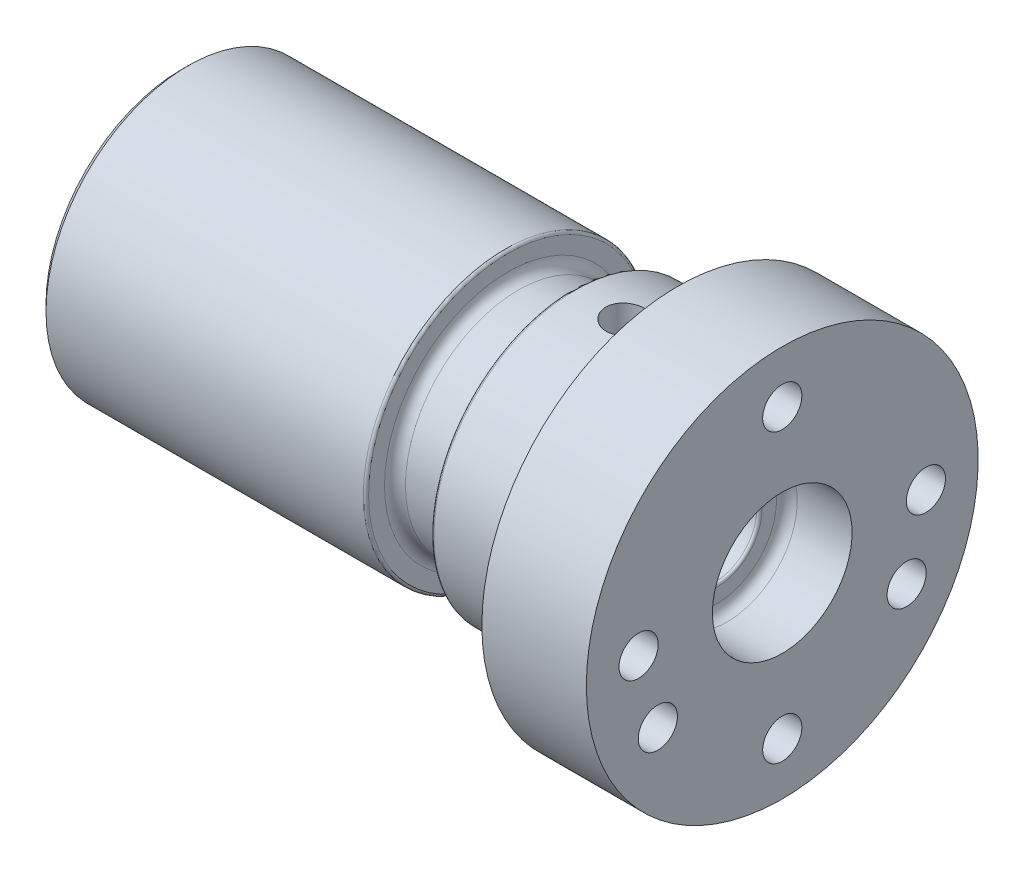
ISO-10303-21;
HEADER;
FILE_DESCRIPTION(('STEP AP214'),'2;1');
FILE_NAME('part.step','',(''),(''),'','','');
FILE_SCHEMA(('AUTOMOTIVE_DESIGN { 1 0 10303 214 1 1 1 1 }'));
ENDSEC;
DATA;
#1=APPLICATION_CONTEXT('core data for automotive mechanical design processes');
#2=APPLICATION_PROTOCOL_DEFINITION('international standard','automotive_design',2000,#1);
#3=PRODUCT_CONTEXT('',#1,'mechanical');
#4=PRODUCT('Part','Part','',(#3));
#5=PRODUCT_RELATED_PRODUCT_CATEGORY('part','',(#4));
#6=PRODUCT_DEFINITION_FORMATION('','',#4);
#7=PRODUCT_DEFINITION_CONTEXT('part definition',#1,'design');
#8=PRODUCT_DEFINITION('design','',#6,#7);
#9=PRODUCT_DEFINITION_SHAPE('','',#8);
#10=(LENGTH_UNIT() NAMED_UNIT(*) SI_UNIT(.MILLI.,.METRE.));
#11=(NAMED_UNIT(*) PLANE_ANGLE_UNIT() SI_UNIT($,.RADIAN.));
#12=(NAMED_UNIT(*) SI_UNIT($,.STERADIAN.) SOLID_ANGLE_UNIT());
#13=UNCERTAINTY_MEASURE_WITH_UNIT(LENGTH_MEASURE(1.E-05),#10,'distance_accuracy_value','');
#14=(GEOMETRIC_REPRESENTATION_CONTEXT(3) GLOBAL_UNCERTAINTY_ASSIGNED_CONTEXT((#13)) GLOBAL_UNIT_ASSIGNED_CONTEXT((#10,
#11,#12)) REPRESENTATION_CONTEXT('',''));
#15=CARTESIAN_POINT('',(0.,0.,0.));
#16=DIRECTION('',(0.,0.,1.));
#17=DIRECTION('',(1.,0.,0.));
#18=AXIS2_PLACEMENT_3D('',#15,#16,#17);
#19=CARTESIAN_POINT('',(0.,0.,0.));
#20=DIRECTION('',(-1.,0.,0.));
#21=DIRECTION('',(0.,0.,1.));
#22=AXIS2_PLACEMENT_3D('',#19,#20,#21);
#23=CYLINDRICAL_SURFACE('',#22,10.875);
#24=CARTESIAN_POINT('',(24.8,0.,0.));
#25=DIRECTION('',(-1.,0.,0.));
#26=DIRECTION('',(0.,0.,1.));
#27=AXIS2_PLACEMENT_3D('',#24,#25,#26);
#28=CIRCLE('',#27,10.875);
#29=CARTESIAN_POINT('',(24.8,0.,10.875));
#30=VERTEX_POINT('',#29);
#31=EDGE_CURVE('E254',#30,#30,#28,.T.);
#32=CARTESIAN_POINT('',(0.5,0.,0.));
#33=DIRECTION('',(1.,0.,0.));
#34=DIRECTION('',(0.,0.,-1.));
#35=AXIS2_PLACEMENT_3D('',#32,#33,#34);
#36=CIRCLE('',#35,10.875);
#37=CARTESIAN_POINT('',(0.500000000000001,0.,10.875));
#38=VERTEX_POINT('',#37);
#39=EDGE_CURVE('E257',#38,#38,#36,.T.);
#40=CARTESIAN_POINT('',(24.8,0.,10.875));
#41=CARTESIAN_POINT('',(24.546875,0.,10.875));
#42=CARTESIAN_POINT('',(24.29375,0.,10.875));
#43=CARTESIAN_POINT('',(23.7875,0.,10.875));
#44=CARTESIAN_POINT('',(23.534375,0.,10.875));
#45=CARTESIAN_POINT('',(23.028125,0.,10.875));
#46=CARTESIAN_POINT('',(22.775,0.,10.875));
#47=CARTESIAN_POINT('',(22.26875,0.,10.875));
#48=CARTESIAN_POINT('',(22.015625,0.,10.875));
#49=CARTESIAN_POINT('',(21.509375,0.,10.875));
#50=CARTESIAN_POINT('',(21.25625,0.,10.875));
#51=CARTESIAN_POINT('',(20.75,0.,10.875));
#52=CARTESIAN_POINT('',(20.496875,0.,10.875));
#53=CARTESIAN_POINT('',(19.990625,0.,10.875));
#54=CARTESIAN_POINT('',(19.7375,0.,10.875));
#55=CARTESIAN_POINT('',(19.23125,0.,10.875));
#56=CARTESIAN_POINT('',(18.978125,0.,10.875));
#57=CARTESIAN_POINT('',(18.471875,0.,10.875));
#58=CARTESIAN_POINT('',(18.21875,0.,10.875));
#59=CARTESIAN_POINT('',(17.7125,0.,10.875));
#60=CARTESIAN_POINT('',(17.459375,0.,10.875));
#61=CARTESIAN_POINT('',(16.953125,0.,10.875));
#62=CARTESIAN_POINT('',(16.7,0.,10.875));
#63=CARTESIAN_POINT('',(16.19375,0.,10.875));
#64=CARTESIAN_POINT('',(15.940625,0.,10.875));
#65=CARTESIAN_POINT('',(15.434375,0.,10.875));
#66=CARTESIAN_POINT('',(15.18125,0.,10.875));
#67=CARTESIAN_POINT('',(14.675,0.,10.875));
#68=CARTESIAN_POINT('',(14.421875,0.,10.875));
#69=CARTESIAN_POINT('',(13.915625,0.,10.875));
#70=CARTESIAN_POINT('',(13.6625,0.,10.875));
#71=CARTESIAN_POINT('',(13.15625,0.,10.875));
#72=CARTESIAN_POINT('',(12.903125,0.,10.875));
#73=CARTESIAN_POINT('',(12.396875,0.,10.875));
#74=CARTESIAN_POINT('',(12.14375,0.,10.875));
#75=CARTESIAN_POINT('',(11.6375,0.,10.875));
#76=CARTESIAN_POINT('',(11.384375,0.,10.875));
#77=CARTESIAN_POINT('',(10.878125,0.,10.875));
#78=CARTESIAN_POINT('',(10.625,0.,10.875));
#79=CARTESIAN_POINT('',(10.11875,0.,10.875));
#80=CARTESIAN_POINT('',(9.86562500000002,0.,10.875));
#81=CARTESIAN_POINT('',(9.35937500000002,0.,10.875));
#82=CARTESIAN_POINT('',(9.10625000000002,0.,10.875));
#83=CARTESIAN_POINT('',(8.60000000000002,0.,10.875));
#84=CARTESIAN_POINT('',(8.34687500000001,0.,10.875));
#85=CARTESIAN_POINT('',(7.84062500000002,0.,10.875));
#86=CARTESIAN_POINT('',(7.58750000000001,0.,10.875));
#87=CARTESIAN_POINT('',(7.08125000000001,0.,10.875));
#88=CARTESIAN_POINT('',(6.82812500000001,0.,10.875));
#89=CARTESIAN_POINT('',(6.32187500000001,0.,10.875));
#90=CARTESIAN_POINT('',(6.06875000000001,0.,10.875));
#91=CARTESIAN_POINT('',(5.56250000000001,0.,10.875));
#92=CARTESIAN_POINT('',(5.30937500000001,0.,10.875));
#93=CARTESIAN_POINT('',(4.80312500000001,0.,10.875));
#94=CARTESIAN_POINT('',(4.55000000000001,0.,10.875));
#95=CARTESIAN_POINT('',(4.04375000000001,0.,10.875));
#96=CARTESIAN_POINT('',(3.79062500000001,0.,10.875));
#97=CARTESIAN_POINT('',(3.28437500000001,0.,10.875));
#98=CARTESIAN_POINT('',(3.03125000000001,0.,10.875));
#99=CARTESIAN_POINT('',(2.525,0.,10.875));
#100=CARTESIAN_POINT('',(2.271875,0.,10.875));
#101=CARTESIAN_POINT('',(1.765625,0.,10.875));
#102=CARTESIAN_POINT('',(1.5125,0.,10.875));
#103=CARTESIAN_POINT('',(1.00625,0.,10.875));
#104=CARTESIAN_POINT('',(0.753125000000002,0.,10.875));
#105=CARTESIAN_POINT('',(0.5,0.,10.875));
#106=B_SPLINE_CURVE_WITH_KNOTS('',3,(#40,#41,#42,#43,#44,#45,#46,#47,#48,#49,#50,#51,#52,#53,
#54,#55,#56,#57,#58,#59,#60,#61,#62,#63,#64,#65,#66,#67,#68,#69,#70,#71,#72,#73,#74,#75,#76,#77,
#78,#79,#80,#81,#82,#83,#84,#85,#86,#87,#88,#89,#90,#91,#92,#93,#94,#95,#96,#97,#98,#99,#100,
#101,#102,#103,#104,#105),.UNSPECIFIED.,.F.,.F.,(4,2,2,2,2,2,2,2,2,2,2,2,2,2,2,2,2,2,2,2,2,2,2,
2,2,2,2,2,2,2,2,2,4),(0.,0.759375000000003,1.51875,2.27812500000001,3.03750000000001,
3.79687500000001,4.55625000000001,5.31562500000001,6.07500000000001,6.83437500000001,
7.59375000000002,8.35312500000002,9.11250000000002,9.87187500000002,10.63125,11.390625,12.15,
12.909375,13.66875,14.428125,15.1875,15.946875,16.70625,17.465625,18.225,18.984375,19.74375,
20.503125,21.2625,22.021875,22.78125,23.540625,24.3000000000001),.UNSPECIFIED.);
#107=EDGE_CURVE('BSEAM44',#30,#38,#106,.T.);
#108=ORIENTED_EDGE('',*,*,#31,.T.);
#109=ORIENTED_EDGE('',*,*,#39,.T.);
#110=ORIENTED_EDGE('',*,*,#107,.T.);
#111=ORIENTED_EDGE('',*,*,#107,.F.);
#112=EDGE_LOOP('',(#108,#110,#109,#111));
#113=FACE_BOUND('',#112,.T.);
#114=ADVANCED_FACE('F44',(#113),#23,.T.);
#115=CARTESIAN_POINT('',(25.,10.875,0.));
#116=DIRECTION('',(-1.,0.,0.));
#117=DIRECTION('',(0.,0.,1.));
#118=AXIS2_PLACEMENT_3D('',#115,#116,#117);
#119=PLANE('',#118);
#120=CARTESIAN_POINT('',(25.,0.,0.));
#121=DIRECTION('',(-1.,0.,0.));
#122=DIRECTION('',(0.,0.,1.));
#123=AXIS2_PLACEMENT_3D('',#120,#121,#122);
#124=CIRCLE('',#123,10.675);
#125=CARTESIAN_POINT('',(25.,0.,10.675));
#126=VERTEX_POINT('',#125);
#127=EDGE_CURVE('E384',#126,#126,#124,.F.);
#128=ORIENTED_EDGE('',*,*,#127,.T.);
#129=EDGE_LOOP('',(#128));
#130=FACE_BOUND('',#129,.T.);
#131=CARTESIAN_POINT('',(25.,0.,0.));
#132=DIRECTION('',(-1.,0.,0.));
#133=DIRECTION('',(0.,0.,1.));
#134=AXIS2_PLACEMENT_3D('',#131,#132,#133);
#135=CIRCLE('',#134,9.45499999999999);
#136=CARTESIAN_POINT('',(25.,0.,9.45500000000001));
#137=VERTEX_POINT('',#136);
#138=EDGE_CURVE('E421',#137,#137,#135,.T.);
#139=ORIENTED_EDGE('',*,*,#138,.T.);
#140=EDGE_LOOP('',(#139));
#141=FACE_BOUND('',#140,.T.);
#142=ADVANCED_FACE('F244',(#130,#141),#119,.F.);
#143=CARTESIAN_POINT('',(0.,0.,0.));
#144=DIRECTION('',(-1.,0.,0.));
#145=DIRECTION('',(0.,0.,1.));
#146=AXIS2_PLACEMENT_3D('',#143,#144,#145);
#147=CYLINDRICAL_SURFACE('',#146,8.65499999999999);
#148=CARTESIAN_POINT('',(29.2,0.,0.));
#149=DIRECTION('',(1.,0.,0.));
#150=DIRECTION('',(0.,0.,-1.));
#151=AXIS2_PLACEMENT_3D('',#148,#149,#150);
#152=CIRCLE('',#151,8.65499999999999);
#153=CARTESIAN_POINT('',(29.2,0.,8.65499999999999));
#154=VERTEX_POINT('',#153);
#155=EDGE_CURVE('E263',#154,#154,#152,.F.);
#156=CARTESIAN_POINT('',(25.7999999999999,0.,0.));
#157=DIRECTION('',(-1.,0.,0.));
#158=DIRECTION('',(0.,0.,1.));
#159=AXIS2_PLACEMENT_3D('',#156,#157,#158);
#160=CIRCLE('',#159,8.65499999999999);
#161=CARTESIAN_POINT('',(25.7999999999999,0.,8.65499999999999));
#162=VERTEX_POINT('',#161);
#163=EDGE_CURVE('E259',#162,#162,#160,.F.);
#164=CARTESIAN_POINT('',(29.2,0.,8.65499999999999));
#165=CARTESIAN_POINT('',(29.1645833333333,0.,8.65499999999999));
#166=CARTESIAN_POINT('',(29.1291666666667,0.,8.65499999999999));
#167=CARTESIAN_POINT('',(29.0583333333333,0.,8.65499999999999));
#168=CARTESIAN_POINT('',(29.0229166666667,0.,8.65499999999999));
#169=CARTESIAN_POINT('',(28.9520833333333,0.,8.65499999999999));
#170=CARTESIAN_POINT('',(28.9166666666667,0.,8.65499999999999));
#171=CARTESIAN_POINT('',(28.8458333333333,0.,8.65499999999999));
#172=CARTESIAN_POINT('',(28.8104166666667,0.,8.65499999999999));
#173=CARTESIAN_POINT('',(28.7395833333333,0.,8.65499999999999));
#174=CARTESIAN_POINT('',(28.7041666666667,0.,8.65499999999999));
#175=CARTESIAN_POINT('',(28.6333333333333,0.,8.65499999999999));
#176=CARTESIAN_POINT('',(28.5979166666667,0.,8.65499999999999));
#177=CARTESIAN_POINT('',(28.5270833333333,0.,8.65499999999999));
#178=CARTESIAN_POINT('',(28.4916666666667,0.,8.65499999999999));
#179=CARTESIAN_POINT('',(28.4208333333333,0.,8.65499999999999));
#180=CARTESIAN_POINT('',(28.3854166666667,0.,8.65499999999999));
#181=CARTESIAN_POINT('',(28.3145833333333,0.,8.65499999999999));
#182=CARTESIAN_POINT('',(28.2791666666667,0.,8.65499999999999));
#183=CARTESIAN_POINT('',(28.2083333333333,0.,8.65499999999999));
#184=CARTESIAN_POINT('',(28.1729166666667,0.,8.65499999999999));
#185=CARTESIAN_POINT('',(28.1020833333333,0.,8.65499999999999));
#186=CARTESIAN_POINT('',(28.0666666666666,0.,8.65499999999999));
#187=CARTESIAN_POINT('',(27.9958333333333,0.,8.65499999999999));
#188=CARTESIAN_POINT('',(27.9604166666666,0.,8.65499999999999));
#189=CARTESIAN_POINT('',(27.8895833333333,0.,8.65499999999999));
#190=CARTESIAN_POINT('',(27.8541666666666,0.,8.65499999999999));
#191=CARTESIAN_POINT('',(27.7833333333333,0.,8.65499999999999));
#192=CARTESIAN_POINT('',(27.7479166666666,0.,8.65499999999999));
#193=CARTESIAN_POINT('',(27.6770833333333,0.,8.65499999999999));
#194=CARTESIAN_POINT('',(27.6416666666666,0.,8.65499999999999));
#195=CARTESIAN_POINT('',(27.5708333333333,0.,8.65499999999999));
#196=CARTESIAN_POINT('',(27.5354166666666,0.,8.65499999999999));
#197=CARTESIAN_POINT('',(27.4645833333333,0.,8.65499999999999));
#198=CARTESIAN_POINT('',(27.4291666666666,0.,8.65499999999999));
#199=CARTESIAN_POINT('',(27.3583333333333,0.,8.65499999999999));
#200=CARTESIAN_POINT('',(27.3229166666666,0.,8.65499999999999));
#201=CARTESIAN_POINT('',(27.2520833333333,0.,8.65499999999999));
#202=CARTESIAN_POINT('',(27.2166666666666,0.,8.65499999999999));
#203=CARTESIAN_POINT('',(27.1458333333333,0.,8.65499999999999));
#204=CARTESIAN_POINT('',(27.1104166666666,0.,8.65499999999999));
#205=CARTESIAN_POINT('',(27.0395833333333,0.,8.65499999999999));
#206=CARTESIAN_POINT('',(27.0041666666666,0.,8.65499999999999));
#207=CARTESIAN_POINT('',(26.9333333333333,0.,8.65499999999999));
#208=CARTESIAN_POINT('',(26.8979166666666,0.,8.65499999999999));
#209=CARTESIAN_POINT('',(26.8270833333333,0.,8.65499999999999));
#210=CARTESIAN_POINT('',(26.7916666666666,0.,8.65499999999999));
#211=CARTESIAN_POINT('',(26.7208333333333,0.,8.65499999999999));
#212=CARTESIAN_POINT('',(26.6854166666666,0.,8.65499999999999));
#213=CARTESIAN_POINT('',(26.6145833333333,0.,8.65499999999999));
#214=CARTESIAN_POINT('',(26.5791666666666,0.,8.65499999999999));
#215=CARTESIAN_POINT('',(26.5083333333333,0.,8.65499999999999));
#216=CARTESIAN_POINT('',(26.4729166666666,0.,8.65499999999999));
#217=CARTESIAN_POINT('',(26.4020833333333,0.,8.65499999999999));
#218=CARTESIAN_POINT('',(26.3666666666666,0.,8.65499999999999));
#219=CARTESIAN_POINT('',(26.2958333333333,0.,8.65499999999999));
#220=CARTESIAN_POINT('',(26.2604166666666,0.,8.65499999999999));
#221=CARTESIAN_POINT('',(26.1895833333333,0.,8.65499999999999));
#222=CARTESIAN_POINT('',(26.1541666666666,0.,8.65499999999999));
#223=CARTESIAN_POINT('',(26.0833333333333,0.,8.65499999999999));
#224=CARTESIAN_POINT('',(26.0479166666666,0.,8.65499999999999));
#225=CARTESIAN_POINT('',(25.9770833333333,0.,8.65499999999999));
#226=CARTESIAN_POINT('',(25.9416666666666,0.,8.65499999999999));
#227=CARTESIAN_POINT('',(25.8708333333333,0.,8.65499999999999));
#228=CARTESIAN_POINT('',(25.8354166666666,0.,8.65499999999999));
#229=CARTESIAN_POINT('',(25.7999999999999,0.,8.65499999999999));
#230=B_SPLINE_CURVE_WITH_KNOTS('',3,(#164,#165,#166,#167,#168,#169,#170,#171,#172,#173,#174,
#175,#176,#177,#178,#179,#180,#181,#182,#183,#184,#185,#186,#187,#188,#189,#190,#191,#192,#193,
#194,#195,#196,#197,#198,#199,#200,#201,#202,#203,#204,#205,#206,#207,#208,#209,#210,#211,#212,
#213,#214,#215,#216,#217,#218,#219,#220,#221,#222,#223,#224,#225,#226,#227,#228,#229),
.UNSPECIFIED.,.F.,.F.,(4,2,2,2,2,2,2,2,2,2,2,2,2,2,2,2,2,2,2,2,2,2,2,2,2,2,2,2,2,2,2,2,4),(0.,
0.106250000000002,0.212500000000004,0.318750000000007,0.425000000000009,0.531250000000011,
0.637500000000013,0.743750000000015,0.850000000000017,0.95625000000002,1.06250000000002,
1.16875000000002,1.27500000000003,1.38125000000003,1.48750000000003,1.59375000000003,
1.70000000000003,1.80625000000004,1.91250000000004,2.01875000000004,2.12500000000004,
2.23125000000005,2.33750000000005,2.44375000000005,2.55000000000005,2.65625000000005,
2.76250000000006,2.86875000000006,2.97500000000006,3.08125000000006,3.18750000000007,
3.29375000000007,3.40000000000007),.UNSPECIFIED.);
#231=EDGE_CURVE('BSEAM249',#154,#162,#230,.T.);
#232=ORIENTED_EDGE('',*,*,#155,.T.);
#233=ORIENTED_EDGE('',*,*,#163,.T.);
#234=ORIENTED_EDGE('',*,*,#231,.T.);
#235=ORIENTED_EDGE('',*,*,#231,.F.);
#236=EDGE_LOOP('',(#232,#234,#233,#235));
#237=FACE_BOUND('',#236,.T.);
#238=ADVANCED_FACE('F249',(#237),#147,.T.);
#239=CARTESIAN_POINT('',(30.,8.65500000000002,0.));
#240=DIRECTION('',(1.,0.,0.));
#241=DIRECTION('',(0.,0.,-1.));
#242=AXIS2_PLACEMENT_3D('',#239,#240,#241);
#243=PLANE('',#242);
#244=CARTESIAN_POINT('',(30.,0.,0.));
#245=DIRECTION('',(1.,0.,0.));
#246=DIRECTION('',(0.,0.,-1.));
#247=AXIS2_PLACEMENT_3D('',#244,#245,#246);
#248=CIRCLE('',#247,10.675);
#249=CARTESIAN_POINT('',(30.,0.,-10.675));
#250=VERTEX_POINT('',#249);
#251=EDGE_CURVE('E378',#250,#250,#248,.F.);
#252=ORIENTED_EDGE('',*,*,#251,.T.);
#253=EDGE_LOOP('',(#252));
#254=FACE_BOUND('',#253,.T.);
#255=CARTESIAN_POINT('',(30.,0.,0.));
#256=DIRECTION('',(1.,0.,0.));
#257=DIRECTION('',(0.,0.,-1.));
#258=AXIS2_PLACEMENT_3D('',#255,#256,#257);
#259=CIRCLE('',#258,9.45499999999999);
#260=CARTESIAN_POINT('',(30.,0.,-9.45499999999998));
#261=VERTEX_POINT('',#260);
#262=EDGE_CURVE('E424',#261,#261,#259,.T.);
#263=ORIENTED_EDGE('',*,*,#262,.T.);
#264=EDGE_LOOP('',(#263));
#265=FACE_BOUND('',#264,.T.);
#266=ADVANCED_FACE('F331',(#254,#265),#243,.F.);
#267=CARTESIAN_POINT('',(0.,0.,0.));
#268=DIRECTION('',(-1.,0.,0.));
#269=DIRECTION('',(0.,0.,1.));
#270=AXIS2_PLACEMENT_3D('',#267,#268,#269);
#271=CYLINDRICAL_SURFACE('',#270,10.875);
#272=CARTESIAN_POINT('',(34.,-10.7710549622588,-1.50000000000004));
#273=CARTESIAN_POINT('',(33.9161754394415,-10.7710562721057,-1.49999648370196));
#274=CARTESIAN_POINT('',(33.8323003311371,-10.7720440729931,-1.49294970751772));
#275=CARTESIAN_POINT('',(33.6668897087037,-10.7758864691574,-1.46495316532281));
#276=CARTESIAN_POINT('',(33.5853566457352,-10.7787429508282,-1.44398935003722));
#277=CARTESIAN_POINT('',(33.4270486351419,-10.7859931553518,-1.38879314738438));
#278=CARTESIAN_POINT('',(33.3502702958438,-10.7903857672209,-1.3545703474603));
#279=CARTESIAN_POINT('',(33.203558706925,-10.8002119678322,-1.27384922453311));
#280=CARTESIAN_POINT('',(33.1336244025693,-10.8056453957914,-1.22735279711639));
#281=CARTESIAN_POINT('',(33.0020988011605,-10.8169822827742,-1.12306679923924));
#282=CARTESIAN_POINT('',(32.9405606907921,-10.8228883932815,-1.06521043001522));
#283=CARTESIAN_POINT('',(32.8280344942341,-10.8344814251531,-0.939990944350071));
#284=CARTESIAN_POINT('',(32.7770469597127,-10.8401683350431,-0.872627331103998));
#285=CARTESIAN_POINT('',(32.6868755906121,-10.8507096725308,-0.729967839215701));
#286=CARTESIAN_POINT('',(32.6477403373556,-10.8555606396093,-0.654640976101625));
#287=CARTESIAN_POINT('',(32.5826958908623,-10.863854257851,-0.498405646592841));
#288=CARTESIAN_POINT('',(32.5567861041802,-10.867296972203,-0.417497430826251));
#289=CARTESIAN_POINT('',(32.519088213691,-10.8723674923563,-0.252942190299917));
#290=CARTESIAN_POINT('',(32.5072113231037,-10.8740067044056,-0.169315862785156));
#291=CARTESIAN_POINT('',(32.4976409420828,-10.8753245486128,-0.00124218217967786));
#292=CARTESIAN_POINT('',(32.4999467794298,-10.8750032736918,0.0832051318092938));
#293=CARTESIAN_POINT('',(32.5186057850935,-10.872445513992,0.249918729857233));
#294=CARTESIAN_POINT('',(32.5348634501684,-10.8702220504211,0.332195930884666));
#295=CARTESIAN_POINT('',(32.5808150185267,-10.8641242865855,0.492843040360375));
#296=CARTESIAN_POINT('',(32.6105092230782,-10.8602499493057,0.571212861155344));
#297=CARTESIAN_POINT('',(32.6825906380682,-10.8512633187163,0.722112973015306));
#298=CARTESIAN_POINT('',(32.7250186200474,-10.8461470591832,0.794623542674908));
#299=CARTESIAN_POINT('',(32.821333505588,-10.835247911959,0.931531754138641));
#300=CARTESIAN_POINT('',(32.8752210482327,-10.8294649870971,0.995928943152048));
#301=CARTESIAN_POINT('',(32.9934588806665,-10.817821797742,1.11534442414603));
#302=CARTESIAN_POINT('',(33.0578924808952,-10.8119612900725,1.17028023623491));
#303=CARTESIAN_POINT('',(33.1951087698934,-10.8008706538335,1.26857100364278));
#304=CARTESIAN_POINT('',(33.2678914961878,-10.7956405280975,1.31192590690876));
#305=CARTESIAN_POINT('',(33.4198196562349,-10.7864029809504,1.38583204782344));
#306=CARTESIAN_POINT('',(33.4989687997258,-10.7823962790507,1.41637575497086));
#307=CARTESIAN_POINT('',(33.6613406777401,-10.7760725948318,1.46371449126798));
#308=CARTESIAN_POINT('',(33.7445631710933,-10.7737555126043,1.48051033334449));
#309=CARTESIAN_POINT('',(33.9119882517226,-10.7710920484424,1.49976541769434));
#310=CARTESIAN_POINT('',(33.9961771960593,-10.7707296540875,1.50234115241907));
#311=CARTESIAN_POINT('',(34.163785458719,-10.771974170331,1.49339113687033));
#312=CARTESIAN_POINT('',(34.2472047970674,-10.7735810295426,1.48186575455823));
#313=CARTESIAN_POINT('',(34.4105509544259,-10.7785683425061,1.44513911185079));
#314=CARTESIAN_POINT('',(34.4904908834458,-10.7819413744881,1.41999506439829));
#315=CARTESIAN_POINT('',(34.6450207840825,-10.7900749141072,1.35680403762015));
#316=CARTESIAN_POINT('',(34.7196105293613,-10.7948354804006,1.31875651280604));
#317=CARTESIAN_POINT('',(34.8618473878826,-10.8052457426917,1.23055538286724));
#318=CARTESIAN_POINT('',(34.9294470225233,-10.8109009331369,1.18032587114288));
#319=CARTESIAN_POINT('',(35.0552985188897,-10.8224463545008,1.06929301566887));
#320=CARTESIAN_POINT('',(35.1135499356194,-10.8283365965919,1.00848916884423));
#321=CARTESIAN_POINT('',(35.2194651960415,-10.8397380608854,0.87752268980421));
#322=CARTESIAN_POINT('',(35.2670521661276,-10.8452463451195,0.807297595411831));
#323=CARTESIAN_POINT('',(35.3497539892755,-10.8552184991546,0.659783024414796));
#324=CARTESIAN_POINT('',(35.3848691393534,-10.8596823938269,0.582493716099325));
#325=CARTESIAN_POINT('',(35.4415056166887,-10.8670498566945,0.42329245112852));
#326=CARTESIAN_POINT('',(35.4630701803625,-10.8699583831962,0.341396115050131));
#327=CARTESIAN_POINT('',(35.4921336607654,-10.873908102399,0.175101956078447));
#328=CARTESIAN_POINT('',(35.4996333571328,-10.8749493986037,0.0907042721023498));
#329=CARTESIAN_POINT('',(35.5003374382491,-10.8750465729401,-0.0774487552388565));
#330=CARTESIAN_POINT('',(35.4936598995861,-10.8741188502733,-0.161203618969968));
#331=CARTESIAN_POINT('',(35.4664506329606,-10.870415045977,-0.32638804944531));
#332=CARTESIAN_POINT('',(35.4459189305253,-10.8676389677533,-0.407817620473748));
#333=CARTESIAN_POINT('',(35.3916236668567,-10.8605488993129,-0.566016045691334));
#334=CARTESIAN_POINT('',(35.3578670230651,-10.8562357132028,-0.642787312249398));
#335=CARTESIAN_POINT('',(35.2780924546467,-10.846547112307,-0.789594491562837));
#336=CARTESIAN_POINT('',(35.2320742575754,-10.8411716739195,-0.859630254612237));
#337=CARTESIAN_POINT('',(35.1286507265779,-10.8299040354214,-0.99157961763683));
#338=CARTESIAN_POINT('',(35.0711578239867,-10.8240080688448,-1.05342426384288));
#339=CARTESIAN_POINT('',(34.9466005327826,-10.8123929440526,-1.16663231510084));
#340=CARTESIAN_POINT('',(34.8795338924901,-10.806673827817,-1.2179932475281));
#341=CARTESIAN_POINT('',(34.7373651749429,-10.7960311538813,-1.30898866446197));
#342=CARTESIAN_POINT('',(34.662226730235,-10.7911114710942,-1.34856676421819));
#343=CARTESIAN_POINT('',(34.5063402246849,-10.7826700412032,-1.41448432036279));
#344=CARTESIAN_POINT('',(34.4255982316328,-10.7791468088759,-1.44083784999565));
#345=CARTESIAN_POINT('',(34.2870539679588,-10.7747322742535,-1.47341045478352));
#346=CARTESIAN_POINT('',(34.2301170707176,-10.7733603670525,-1.48336674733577));
#347=CARTESIAN_POINT('',(34.1154614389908,-10.7715212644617,-1.49666269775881));
#348=CARTESIAN_POINT('',(34.0577427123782,-10.7710540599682,-1.50000242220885));
#349=CARTESIAN_POINT('',(34.,-10.7710549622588,-1.50000000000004));
#350=B_SPLINE_CURVE_WITH_KNOTS('',3,(#272,#273,#274,#275,#276,#277,#278,#279,#280,#281,#282,
#283,#284,#285,#286,#287,#288,#289,#290,#291,#292,#293,#294,#295,#296,#297,#298,#299,#300,#301,
#302,#303,#304,#305,#306,#307,#308,#309,#310,#311,#312,#313,#314,#315,#316,#317,#318,#319,#320,
#321,#322,#323,#324,#325,#326,#327,#328,#329,#330,#331,#332,#333,#334,#335,#336,#337,#338,#339,
#340,#341,#342,#343,#344,#345,#346,#347,#348,#349),.UNSPECIFIED.,.T.,.F.,(4,2,2,2,2,2,2,2,2,2,2,
2,2,2,2,2,2,2,2,2,2,2,2,2,2,2,2,2,2,2,2,2,2,2,2,2,2,2,4),(0.,0.251262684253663,
0.502779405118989,0.754114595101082,1.00541099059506,1.25823187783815,1.51106598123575,
1.76492282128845,2.01876826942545,2.27099887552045,2.52321752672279,2.77372333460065,
3.02423475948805,3.27555699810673,3.52689325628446,3.78032038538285,4.03374865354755,
4.28732568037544,4.54088771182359,4.79236942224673,5.04384457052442,5.29427135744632,
5.54470873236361,5.79674860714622,6.04880047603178,6.30261463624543,6.55642275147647,
6.80941686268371,7.06239694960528,7.31327833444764,7.5641592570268,7.81490912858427,
8.06566457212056,8.31841233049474,8.57121963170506,8.82521794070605,9.07894537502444,
9.25202990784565,9.42511269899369),.UNSPECIFIED.);
#351=CARTESIAN_POINT('',(34.,-10.7710549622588,-1.50000000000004));
#352=VERTEX_POINT('',#351);
#353=EDGE_CURVE('E163',#352,#352,#350,.T.);
#354=ORIENTED_EDGE('',*,*,#353,.T.);
#355=EDGE_LOOP('',(#354));
#356=FACE_BOUND('',#355,.T.);
#357=CARTESIAN_POINT('',(30.2,0.,0.));
#358=DIRECTION('',(1.,0.,0.));
#359=DIRECTION('',(0.,0.,-1.));
#360=AXIS2_PLACEMENT_3D('',#357,#358,#359);
#361=CIRCLE('',#360,10.875);
#362=CARTESIAN_POINT('',(30.2,0.,-10.875));
#363=VERTEX_POINT('',#362);
#364=EDGE_CURVE('E372',#363,#363,#361,.T.);
#365=ORIENTED_EDGE('',*,*,#364,.T.);
#366=EDGE_LOOP('',(#365));
#367=FACE_BOUND('',#366,.T.);
#368=CARTESIAN_POINT('',(34.,10.7710549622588,1.50000000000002));
#369=CARTESIAN_POINT('',(33.9161754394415,10.7710562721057,1.49999648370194));
#370=CARTESIAN_POINT('',(33.8323003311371,10.7720440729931,1.49294970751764));
#371=CARTESIAN_POINT('',(33.6668897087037,10.7758864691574,1.46495316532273));
#372=CARTESIAN_POINT('',(33.5853566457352,10.7787429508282,1.4439893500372));
#373=CARTESIAN_POINT('',(33.4270486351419,10.7859931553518,1.38879314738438));
#374=CARTESIAN_POINT('',(33.3502702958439,10.7903857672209,1.35457034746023));
#375=CARTESIAN_POINT('',(33.203558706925,10.8002119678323,1.27384922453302));
#376=CARTESIAN_POINT('',(33.1336244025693,10.8056453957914,1.22735279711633));
#377=CARTESIAN_POINT('',(33.0020988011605,10.8169822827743,1.12306679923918));
#378=CARTESIAN_POINT('',(32.9405606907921,10.8228883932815,1.06521043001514));
#379=CARTESIAN_POINT('',(32.8280344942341,10.834481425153,0.939990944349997));
#380=CARTESIAN_POINT('',(32.7770469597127,10.8401683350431,0.872627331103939));
#381=CARTESIAN_POINT('',(32.6868755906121,10.8507096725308,0.729967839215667));
#382=CARTESIAN_POINT('',(32.6477403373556,10.8555606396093,0.654640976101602));
#383=CARTESIAN_POINT('',(32.5826958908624,10.863854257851,0.498405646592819));
#384=CARTESIAN_POINT('',(32.5567861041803,10.867296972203,0.417497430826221));
#385=CARTESIAN_POINT('',(32.5190882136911,10.8723674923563,0.25294219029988));
#386=CARTESIAN_POINT('',(32.5072113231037,10.8740067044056,0.16931586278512));
#387=CARTESIAN_POINT('',(32.4976409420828,10.8753245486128,0.00124218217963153));
#388=CARTESIAN_POINT('',(32.4999467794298,10.8750032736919,-0.08320513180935));
#389=CARTESIAN_POINT('',(32.5186057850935,10.872445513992,-0.249918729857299));
#390=CARTESIAN_POINT('',(32.5348634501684,10.8702220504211,-0.332195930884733));
#391=CARTESIAN_POINT('',(32.5808150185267,10.8641242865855,-0.492843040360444));
#392=CARTESIAN_POINT('',(32.6105092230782,10.8602499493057,-0.571212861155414));
#393=CARTESIAN_POINT('',(32.6825906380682,10.8512633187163,-0.722112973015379));
#394=CARTESIAN_POINT('',(32.7250186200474,10.8461470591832,-0.794623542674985));
#395=CARTESIAN_POINT('',(32.821333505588,10.835247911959,-0.931531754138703));
#396=CARTESIAN_POINT('',(32.8752210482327,10.8294649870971,-0.99592894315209));
#397=CARTESIAN_POINT('',(32.9934588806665,10.817821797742,-1.11534442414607));
#398=CARTESIAN_POINT('',(33.0578924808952,10.8119612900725,-1.17028023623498));
#399=CARTESIAN_POINT('',(33.1951087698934,10.8008706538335,-1.26857100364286));
#400=CARTESIAN_POINT('',(33.2678914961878,10.7956405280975,-1.31192590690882));
#401=CARTESIAN_POINT('',(33.4198196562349,10.7864029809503,-1.3858320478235));
#402=CARTESIAN_POINT('',(33.4989687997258,10.7823962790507,-1.41637575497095));
#403=CARTESIAN_POINT('',(33.6613406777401,10.7760725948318,-1.46371449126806));
#404=CARTESIAN_POINT('',(33.7445631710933,10.7737555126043,-1.48051033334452));
#405=CARTESIAN_POINT('',(33.9119882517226,10.7710920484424,-1.49976541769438));
#406=CARTESIAN_POINT('',(33.9961771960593,10.7707296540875,-1.50234115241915));
#407=CARTESIAN_POINT('',(34.163785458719,10.771974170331,-1.49339113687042));
#408=CARTESIAN_POINT('',(34.2472047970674,10.7735810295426,-1.48186575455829));
#409=CARTESIAN_POINT('',(34.4105509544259,10.7785683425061,-1.44513911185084));
#410=CARTESIAN_POINT('',(34.4904908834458,10.781941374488,-1.41999506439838));
#411=CARTESIAN_POINT('',(34.6450207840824,10.7900749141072,-1.35680403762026));
#412=CARTESIAN_POINT('',(34.7196105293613,10.7948354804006,-1.31875651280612));
#413=CARTESIAN_POINT('',(34.8618473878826,10.8052457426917,-1.23055538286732));
#414=CARTESIAN_POINT('',(34.9294470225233,10.8109009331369,-1.18032587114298));
#415=CARTESIAN_POINT('',(35.0552985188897,10.8224463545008,-1.06929301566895));
#416=CARTESIAN_POINT('',(35.1135499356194,10.8283365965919,-1.00848916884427));
#417=CARTESIAN_POINT('',(35.2194651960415,10.8397380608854,-0.877522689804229));
#418=CARTESIAN_POINT('',(35.2670521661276,10.8452463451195,-0.807297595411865));
#419=CARTESIAN_POINT('',(35.3497539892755,10.8552184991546,-0.659783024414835));
#420=CARTESIAN_POINT('',(35.3848691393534,10.8596823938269,-0.582493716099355));
#421=CARTESIAN_POINT('',(35.4415056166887,10.8670498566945,-0.423292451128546));
#422=CARTESIAN_POINT('',(35.4630701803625,10.8699583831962,-0.341396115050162));
#423=CARTESIAN_POINT('',(35.4921336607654,10.873908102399,-0.175101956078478));
#424=CARTESIAN_POINT('',(35.4996333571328,10.8749493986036,-0.0907042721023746));
#425=CARTESIAN_POINT('',(35.500337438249,10.8750465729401,0.0774487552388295));
#426=CARTESIAN_POINT('',(35.4936598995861,10.8741188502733,0.161203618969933));
#427=CARTESIAN_POINT('',(35.4664506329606,10.870415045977,0.326388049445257));
#428=CARTESIAN_POINT('',(35.4459189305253,10.8676389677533,0.407817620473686));
#429=CARTESIAN_POINT('',(35.3916236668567,10.8605488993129,0.566016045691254));
#430=CARTESIAN_POINT('',(35.3578670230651,10.8562357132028,0.642787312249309));
#431=CARTESIAN_POINT('',(35.2780924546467,10.846547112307,0.789594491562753));
#432=CARTESIAN_POINT('',(35.2320742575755,10.8411716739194,0.859630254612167));
#433=CARTESIAN_POINT('',(35.1286507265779,10.8299040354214,0.991579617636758));
#434=CARTESIAN_POINT('',(35.0711578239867,10.8240080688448,1.0534242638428));
#435=CARTESIAN_POINT('',(34.9466005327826,10.8123929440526,1.16663231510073));
#436=CARTESIAN_POINT('',(34.8795338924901,10.806673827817,1.217993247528));
#437=CARTESIAN_POINT('',(34.7373651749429,10.7960311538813,1.30898866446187));
#438=CARTESIAN_POINT('',(34.662226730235,10.7911114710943,1.34856676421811));
#439=CARTESIAN_POINT('',(34.5063402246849,10.7826700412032,1.41448432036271));
#440=CARTESIAN_POINT('',(34.4255982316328,10.7791468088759,1.44083784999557));
#441=CARTESIAN_POINT('',(34.2870539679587,10.7747322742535,1.47341045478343));
#442=CARTESIAN_POINT('',(34.2301170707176,10.7733603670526,1.48336674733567));
#443=CARTESIAN_POINT('',(34.1154614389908,10.7715212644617,1.49666269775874));
#444=CARTESIAN_POINT('',(34.0577427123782,10.7710540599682,1.50000242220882));
#445=CARTESIAN_POINT('',(34.,10.7710549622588,1.50000000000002));
#446=B_SPLINE_CURVE_WITH_KNOTS('',3,(#368,#369,#370,#371,#372,#373,#374,#375,#376,#377,#378,
#379,#380,#381,#382,#383,#384,#385,#386,#387,#388,#389,#390,#391,#392,#393,#394,#395,#396,#397,
#398,#399,#400,#401,#402,#403,#404,#405,#406,#407,#408,#409,#410,#411,#412,#413,#414,#415,#416,
#417,#418,#419,#420,#421,#422,#423,#424,#425,#426,#427,#428,#429,#430,#431,#432,#433,#434,#435,
#436,#437,#438,#439,#440,#441,#442,#443,#444,#445),.UNSPECIFIED.,.T.,.F.,(4,2,2,2,2,2,2,2,2,2,2,
2,2,2,2,2,2,2,2,2,2,2,2,2,2,2,2,2,2,2,2,2,2,2,2,2,2,2,4),(0.,0.251262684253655,
0.502779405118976,0.754114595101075,1.00541099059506,1.25823187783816,1.51106598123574,
1.7649228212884,2.01876826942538,2.27099887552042,2.52321752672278,2.77372333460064,
3.02423475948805,3.27555699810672,3.52689325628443,3.78032038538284,4.03374865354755,
4.28732568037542,4.54088771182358,4.79236942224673,5.04384457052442,5.29427135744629,
5.54470873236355,5.7967486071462,6.04880047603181,6.30261463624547,6.5564227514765,
6.80941686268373,7.06239694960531,7.31327833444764,7.56415925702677,7.81490912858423,
8.06566457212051,8.31841233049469,8.57121963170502,8.82521794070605,9.07894537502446,
9.25202990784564,9.42511269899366),.UNSPECIFIED.);
#447=CARTESIAN_POINT('',(34.,10.7710549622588,1.50000000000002));
#448=VERTEX_POINT('',#447);
#449=EDGE_CURVE('E270',#448,#448,#446,.T.);
#450=ORIENTED_EDGE('',*,*,#449,.T.);
#451=EDGE_LOOP('',(#450));
#452=FACE_BOUND('',#451,.T.);
#453=CARTESIAN_POINT('',(38.,0.,0.));
#454=DIRECTION('',(-1.,0.,0.));
#455=DIRECTION('',(0.,0.,1.));
#456=AXIS2_PLACEMENT_3D('',#453,#454,#455);
#457=CIRCLE('',#456,10.875);
#458=CARTESIAN_POINT('',(38.,0.,10.875));
#459=VERTEX_POINT('',#458);
#460=EDGE_CURVE('E266',#459,#459,#457,.T.);
#461=ORIENTED_EDGE('',*,*,#460,.T.);
#462=EDGE_LOOP('',(#461));
#463=FACE_BOUND('',#462,.T.);
#464=ADVANCED_FACE('F279',(#356,#367,#452,#463),#271,.T.);
#465=CARTESIAN_POINT('',(38.,10.875,0.));
#466=DIRECTION('',(1.,0.,0.));
#467=DIRECTION('',(0.,0.,-1.));
#468=AXIS2_PLACEMENT_3D('',#465,#466,#467);
#469=PLANE('',#468);
#470=ORIENTED_EDGE('',*,*,#460,.F.);
#471=EDGE_LOOP('',(#470));
#472=FACE_BOUND('',#471,.T.);
#473=CARTESIAN_POINT('',(38.,0.,0.));
#474=DIRECTION('',(-1.,0.,0.));
#475=DIRECTION('',(0.,0.,1.));
#476=AXIS2_PLACEMENT_3D('',#473,#474,#475);
#477=CIRCLE('',#476,15.);
#478=CARTESIAN_POINT('',(38.,0.,15.));
#479=VERTEX_POINT('',#478);
#480=EDGE_CURVE('E338',#479,#479,#477,.T.);
#481=ORIENTED_EDGE('',*,*,#480,.T.);
#482=EDGE_LOOP('',(#481));
#483=FACE_BOUND('',#482,.T.);
#484=ADVANCED_FACE('F324',(#472,#483),#469,.F.);
#485=CARTESIAN_POINT('',(0.,0.,0.));
#486=DIRECTION('',(-1.,0.,0.));
#487=DIRECTION('',(0.,0.,1.));
#488=AXIS2_PLACEMENT_3D('',#485,#486,#487);
#489=CYLINDRICAL_SURFACE('',#488,15.);
#490=CARTESIAN_POINT('',(46.,0.,0.));
#491=DIRECTION('',(-1.,0.,0.));
#492=DIRECTION('',(0.,0.,1.));
#493=AXIS2_PLACEMENT_3D('',#490,#491,#492);
#494=CIRCLE('',#493,15.);
#495=CARTESIAN_POINT('',(46.,0.,15.));
#496=VERTEX_POINT('',#495);
#497=EDGE_CURVE('E339',#496,#496,#494,.T.);
#498=CARTESIAN_POINT('',(38.,0.,15.));
#499=CARTESIAN_POINT('',(38.0833333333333,0.,15.));
#500=CARTESIAN_POINT('',(38.1666666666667,0.,15.));
#501=CARTESIAN_POINT('',(38.3333333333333,0.,15.));
#502=CARTESIAN_POINT('',(38.4166666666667,0.,15.));
#503=CARTESIAN_POINT('',(38.5833333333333,0.,15.));
#504=CARTESIAN_POINT('',(38.6666666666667,0.,15.));
#505=CARTESIAN_POINT('',(38.8333333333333,0.,15.));
#506=CARTESIAN_POINT('',(38.9166666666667,0.,15.));
#507=CARTESIAN_POINT('',(39.0833333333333,0.,15.));
#508=CARTESIAN_POINT('',(39.1666666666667,0.,15.));
#509=CARTESIAN_POINT('',(39.3333333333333,0.,15.));
#510=CARTESIAN_POINT('',(39.4166666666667,0.,15.));
#511=CARTESIAN_POINT('',(39.5833333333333,0.,15.));
#512=CARTESIAN_POINT('',(39.6666666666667,0.,15.));
#513=CARTESIAN_POINT('',(39.8333333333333,0.,15.));
#514=CARTESIAN_POINT('',(39.9166666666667,0.,15.));
#515=CARTESIAN_POINT('',(40.0833333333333,0.,15.));
#516=CARTESIAN_POINT('',(40.1666666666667,0.,15.));
#517=CARTESIAN_POINT('',(40.3333333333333,0.,15.));
#518=CARTESIAN_POINT('',(40.4166666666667,0.,15.));
#519=CARTESIAN_POINT('',(40.5833333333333,0.,15.));
#520=CARTESIAN_POINT('',(40.6666666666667,0.,15.));
#521=CARTESIAN_POINT('',(40.8333333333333,0.,15.));
#522=CARTESIAN_POINT('',(40.9166666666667,0.,15.));
#523=CARTESIAN_POINT('',(41.0833333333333,0.,15.));
#524=CARTESIAN_POINT('',(41.1666666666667,0.,15.));
#525=CARTESIAN_POINT('',(41.3333333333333,0.,15.));
#526=CARTESIAN_POINT('',(41.4166666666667,0.,15.));
#527=CARTESIAN_POINT('',(41.5833333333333,0.,15.));
#528=CARTESIAN_POINT('',(41.6666666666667,0.,15.));
#529=CARTESIAN_POINT('',(41.8333333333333,0.,15.));
#530=CARTESIAN_POINT('',(41.9166666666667,0.,15.));
#531=CARTESIAN_POINT('',(42.0833333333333,0.,15.));
#532=CARTESIAN_POINT('',(42.1666666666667,0.,15.));
#533=CARTESIAN_POINT('',(42.3333333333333,0.,15.));
#534=CARTESIAN_POINT('',(42.4166666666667,0.,15.));
#535=CARTESIAN_POINT('',(42.5833333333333,0.,15.));
#536=CARTESIAN_POINT('',(42.6666666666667,0.,15.));
#537=CARTESIAN_POINT('',(42.8333333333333,0.,15.));
#538=CARTESIAN_POINT('',(42.9166666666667,0.,15.));
#539=CARTESIAN_POINT('',(43.0833333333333,0.,15.));
#540=CARTESIAN_POINT('',(43.1666666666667,0.,15.));
#541=CARTESIAN_POINT('',(43.3333333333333,0.,15.));
#542=CARTESIAN_POINT('',(43.4166666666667,0.,15.));
#543=CARTESIAN_POINT('',(43.5833333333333,0.,15.));
#544=CARTESIAN_POINT('',(43.6666666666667,0.,15.));
#545=CARTESIAN_POINT('',(43.8333333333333,0.,15.));
#546=CARTESIAN_POINT('',(43.9166666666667,0.,15.));
#547=CARTESIAN_POINT('',(44.0833333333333,0.,15.));
#548=CARTESIAN_POINT('',(44.1666666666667,0.,15.));
#549=CARTESIAN_POINT('',(44.3333333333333,0.,15.));
#550=CARTESIAN_POINT('',(44.4166666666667,0.,15.));
#551=CARTESIAN_POINT('',(44.5833333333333,0.,15.));
#552=CARTESIAN_POINT('',(44.6666666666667,0.,15.));
#553=CARTESIAN_POINT('',(44.8333333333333,0.,15.));
#554=CARTESIAN_POINT('',(44.9166666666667,0.,15.));
#555=CARTESIAN_POINT('',(45.0833333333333,0.,15.));
#556=CARTESIAN_POINT('',(45.1666666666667,0.,15.));
#557=CARTESIAN_POINT('',(45.3333333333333,0.,15.));
#558=CARTESIAN_POINT('',(45.4166666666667,0.,15.));
#559=CARTESIAN_POINT('',(45.5833333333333,0.,15.));
#560=CARTESIAN_POINT('',(45.6666666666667,0.,15.));
#561=CARTESIAN_POINT('',(45.8333333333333,0.,15.));
#562=CARTESIAN_POINT('',(45.9166666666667,0.,15.));
#563=CARTESIAN_POINT('',(46.,0.,15.));
#564=B_SPLINE_CURVE_WITH_KNOTS('',3,(#498,#499,#500,#501,#502,#503,#504,#505,#506,#507,#508,
#509,#510,#511,#512,#513,#514,#515,#516,#517,#518,#519,#520,#521,#522,#523,#524,#525,#526,#527,
#528,#529,#530,#531,#532,#533,#534,#535,#536,#537,#538,#539,#540,#541,#542,#543,#544,#545,#546,
#547,#548,#549,#550,#551,#552,#553,#554,#555,#556,#557,#558,#559,#560,#561,#562,#563),
.UNSPECIFIED.,.F.,.F.,(4,2,2,2,2,2,2,2,2,2,2,2,2,2,2,2,2,2,2,2,2,2,2,2,2,2,2,2,2,2,2,2,4),(0.,
0.25,0.5,0.750000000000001,1.,1.25,1.5,1.75,2.,2.25,2.5,2.75,3.,3.25,3.5,3.75,4.,4.25,4.5,4.75,
5.,5.25,5.50000000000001,5.75000000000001,6.00000000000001,6.25000000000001,6.50000000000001,
6.75000000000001,7.00000000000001,7.25000000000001,7.50000000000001,7.75000000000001,
8.00000000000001),.UNSPECIFIED.);
#565=EDGE_CURVE('BSEAM321',#479,#496,#564,.T.);
#566=ORIENTED_EDGE('',*,*,#480,.F.);
#567=ORIENTED_EDGE('',*,*,#497,.T.);
#568=ORIENTED_EDGE('',*,*,#565,.T.);
#569=ORIENTED_EDGE('',*,*,#565,.F.);
#570=EDGE_LOOP('',(#566,#568,#567,#569));
#571=FACE_BOUND('',#570,.T.);
#572=ADVANCED_FACE('F321',(#571),#489,.T.);
#573=CARTESIAN_POINT('',(46.,15.,0.));
#574=DIRECTION('',(-1.,0.,0.));
#575=DIRECTION('',(0.,0.,1.));
#576=AXIS2_PLACEMENT_3D('',#573,#574,#575);
#577=PLANE('',#576);
#578=CARTESIAN_POINT('',(46.,1.00613961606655E-13,-11.));
#579=DIRECTION('',(1.,0.,0.));
#580=DIRECTION('',(0.,0.,-1.));
#581=AXIS2_PLACEMENT_3D('',#578,#579,#580);
#582=CIRCLE('',#581,1.5);
#583=CARTESIAN_POINT('',(46.,1.00655838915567E-13,-12.5));
#584=VERTEX_POINT('',#583);
#585=EDGE_CURVE('E112',#584,#584,#582,.T.);
#586=ORIENTED_EDGE('',*,*,#585,.F.);
#587=EDGE_LOOP('',(#586));
#588=FACE_BOUND('',#587,.T.);
#589=CARTESIAN_POINT('',(45.9999999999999,-11.,0.));
#590=DIRECTION('',(1.,0.,0.));
#591=DIRECTION('',(0.,0.,-1.));
#592=AXIS2_PLACEMENT_3D('',#589,#590,#591);
#593=CIRCLE('',#592,1.5);
#594=CARTESIAN_POINT('',(45.9999999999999,-11.,-1.50000000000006));
#595=VERTEX_POINT('',#594);
#596=EDGE_CURVE('E120',#595,#595,#593,.T.);
#597=ORIENTED_EDGE('',*,*,#596,.F.);
#598=EDGE_LOOP('',(#597));
#599=FACE_BOUND('',#598,.T.);
#600=CARTESIAN_POINT('',(46.,0.,11.));
#601=DIRECTION('',(1.,0.,0.));
#602=DIRECTION('',(0.,0.,-1.));
#603=AXIS2_PLACEMENT_3D('',#600,#601,#602);
#604=CIRCLE('',#603,1.5);
#605=CARTESIAN_POINT('',(46.,0.,9.49999999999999));
#606=VERTEX_POINT('',#605);
#607=EDGE_CURVE('E126',#606,#606,#604,.T.);
#608=ORIENTED_EDGE('',*,*,#607,.F.);
#609=EDGE_LOOP('',(#608));
#610=FACE_BOUND('',#609,.T.);
#611=CARTESIAN_POINT('',(46.,-5.49999999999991,-9.52627944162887));
#612=DIRECTION('',(1.,0.,0.));
#613=DIRECTION('',(0.,0.,-1.));
#614=AXIS2_PLACEMENT_3D('',#611,#612,#613);
#615=CIRCLE('',#614,1.49999999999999);
#616=CARTESIAN_POINT('',(46.,-5.49999999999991,-11.0262794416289));
#617=VERTEX_POINT('',#616);
#618=EDGE_CURVE('E154',#617,#617,#615,.T.);
#619=ORIENTED_EDGE('',*,*,#618,.F.);
#620=EDGE_LOOP('',(#619));
#621=FACE_BOUND('',#620,.T.);
#622=CARTESIAN_POINT('',(46.,-5.50000000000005,9.52627944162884));
#623=DIRECTION('',(1.,0.,0.));
#624=DIRECTION('',(0.,0.,-1.));
#625=AXIS2_PLACEMENT_3D('',#622,#623,#624);
#626=CIRCLE('',#625,1.49999999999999);
#627=CARTESIAN_POINT('',(46.,-5.50000000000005,8.02627944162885));
#628=VERTEX_POINT('',#627);
#629=EDGE_CURVE('E160',#628,#628,#626,.T.);
#630=ORIENTED_EDGE('',*,*,#629,.F.);
#631=EDGE_LOOP('',(#630));
#632=FACE_BOUND('',#631,.T.);
#633=CARTESIAN_POINT('',(46.,11.,0.));
#634=DIRECTION('',(1.,0.,0.));
#635=DIRECTION('',(0.,0.,-1.));
#636=AXIS2_PLACEMENT_3D('',#633,#634,#635);
#637=CIRCLE('',#636,1.49999999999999);
#638=CARTESIAN_POINT('',(46.,11.,-1.50000000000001));
#639=VERTEX_POINT('',#638);
#640=EDGE_CURVE('E357',#639,#639,#637,.T.);
#641=ORIENTED_EDGE('',*,*,#640,.F.);
#642=EDGE_LOOP('',(#641));
#643=FACE_BOUND('',#642,.T.);
#644=ORIENTED_EDGE('',*,*,#497,.F.);
#645=EDGE_LOOP('',(#644));
#646=FACE_BOUND('',#645,.T.);
#647=CARTESIAN_POINT('',(46.,0.,0.));
#648=DIRECTION('',(-1.,0.,0.));
#649=DIRECTION('',(0.,0.,1.));
#650=AXIS2_PLACEMENT_3D('',#647,#648,#649);
#651=CIRCLE('',#650,5.35);
#652=CARTESIAN_POINT('',(46.,0.,5.35));
#653=VERTEX_POINT('',#652);
#654=EDGE_CURVE('E342',#653,#653,#651,.T.);
#655=ORIENTED_EDGE('',*,*,#654,.T.);
#656=EDGE_LOOP('',(#655));
#657=FACE_BOUND('',#656,.T.);
#658=ADVANCED_FACE('F317',(#588,#599,#610,#621,#632,#643,#646,#657),#577,.F.);
#659=CARTESIAN_POINT('',(0.,0.,0.));
#660=DIRECTION('',(-1.,0.,0.));
#661=DIRECTION('',(0.,0.,1.));
#662=AXIS2_PLACEMENT_3D('',#659,#660,#661);
#663=CYLINDRICAL_SURFACE('',#662,5.35);
#664=CARTESIAN_POINT('',(41.8,0.,0.));
#665=DIRECTION('',(-1.,0.,0.));
#666=DIRECTION('',(0.,0.,1.));
#667=AXIS2_PLACEMENT_3D('',#664,#665,#666);
#668=CIRCLE('',#667,5.35);
#669=CARTESIAN_POINT('',(41.8,0.,5.35));
#670=VERTEX_POINT('',#669);
#671=EDGE_CURVE('E377',#670,#670,#668,.T.);
#672=CARTESIAN_POINT('',(41.8,0.,5.35));
#673=CARTESIAN_POINT('',(41.84375,0.,5.35));
#674=CARTESIAN_POINT('',(41.8875,0.,5.35));
#675=CARTESIAN_POINT('',(41.975,0.,5.35));
#676=CARTESIAN_POINT('',(42.01875,0.,5.35));
#677=CARTESIAN_POINT('',(42.10625,0.,5.35));
#678=CARTESIAN_POINT('',(42.15,0.,5.35));
#679=CARTESIAN_POINT('',(42.2375,0.,5.35));
#680=CARTESIAN_POINT('',(42.28125,0.,5.35));
#681=CARTESIAN_POINT('',(42.36875,0.,5.35));
#682=CARTESIAN_POINT('',(42.4125,0.,5.35));
#683=CARTESIAN_POINT('',(42.5,0.,5.35));
#684=CARTESIAN_POINT('',(42.54375,0.,5.35));
#685=CARTESIAN_POINT('',(42.63125,0.,5.35));
#686=CARTESIAN_POINT('',(42.675,0.,5.35));
#687=CARTESIAN_POINT('',(42.7625,0.,5.35));
#688=CARTESIAN_POINT('',(42.80625,0.,5.35));
#689=CARTESIAN_POINT('',(42.89375,0.,5.35));
#690=CARTESIAN_POINT('',(42.9375,0.,5.35));
#691=CARTESIAN_POINT('',(43.025,0.,5.35));
#692=CARTESIAN_POINT('',(43.06875,0.,5.35));
#693=CARTESIAN_POINT('',(43.15625,0.,5.35));
#694=CARTESIAN_POINT('',(43.2,0.,5.35));
#695=CARTESIAN_POINT('',(43.2875,0.,5.35));
#696=CARTESIAN_POINT('',(43.33125,0.,5.35));
#697=CARTESIAN_POINT('',(43.41875,0.,5.35));
#698=CARTESIAN_POINT('',(43.4625,0.,5.35));
#699=CARTESIAN_POINT('',(43.55,0.,5.35));
#700=CARTESIAN_POINT('',(43.59375,0.,5.35));
#701=CARTESIAN_POINT('',(43.68125,0.,5.35));
#702=CARTESIAN_POINT('',(43.725,0.,5.35));
#703=CARTESIAN_POINT('',(43.8125,0.,5.35));
#704=CARTESIAN_POINT('',(43.85625,0.,5.35));
#705=CARTESIAN_POINT('',(43.94375,0.,5.35));
#706=CARTESIAN_POINT('',(43.9875,0.,5.35));
#707=CARTESIAN_POINT('',(44.075,0.,5.35));
#708=CARTESIAN_POINT('',(44.11875,0.,5.35));
#709=CARTESIAN_POINT('',(44.20625,0.,5.35));
#710=CARTESIAN_POINT('',(44.25,0.,5.35));
#711=CARTESIAN_POINT('',(44.3375,0.,5.35));
#712=CARTESIAN_POINT('',(44.38125,0.,5.35));
#713=CARTESIAN_POINT('',(44.46875,0.,5.35));
#714=CARTESIAN_POINT('',(44.5125,0.,5.35));
#715=CARTESIAN_POINT('',(44.6,0.,5.35));
#716=CARTESIAN_POINT('',(44.64375,0.,5.35));
#717=CARTESIAN_POINT('',(44.73125,0.,5.35));
#718=CARTESIAN_POINT('',(44.775,0.,5.35));
#719=CARTESIAN_POINT('',(44.8625,0.,5.35));
#720=CARTESIAN_POINT('',(44.90625,0.,5.35));
#721=CARTESIAN_POINT('',(44.99375,0.,5.35));
#722=CARTESIAN_POINT('',(45.0375,0.,5.35));
#723=CARTESIAN_POINT('',(45.125,0.,5.35));
#724=CARTESIAN_POINT('',(45.16875,0.,5.35));
#725=CARTESIAN_POINT('',(45.25625,0.,5.35));
#726=CARTESIAN_POINT('',(45.3,0.,5.35));
#727=CARTESIAN_POINT('',(45.3875,0.,5.35));
#728=CARTESIAN_POINT('',(45.43125,0.,5.35));
#729=CARTESIAN_POINT('',(45.51875,0.,5.35));
#730=CARTESIAN_POINT('',(45.5625,0.,5.35));
#731=CARTESIAN_POINT('',(45.65,0.,5.35));
#732=CARTESIAN_POINT('',(45.69375,0.,5.35));
#733=CARTESIAN_POINT('',(45.78125,0.,5.35));
#734=CARTESIAN_POINT('',(45.825,0.,5.35));
#735=CARTESIAN_POINT('',(45.9125,0.,5.35));
#736=CARTESIAN_POINT('',(45.95625,0.,5.35));
#737=CARTESIAN_POINT('',(46.,0.,5.35));
#738=B_SPLINE_CURVE_WITH_KNOTS('',3,(#672,#673,#674,#675,#676,#677,#678,#679,#680,#681,#682,
#683,#684,#685,#686,#687,#688,#689,#690,#691,#692,#693,#694,#695,#696,#697,#698,#699,#700,#701,
#702,#703,#704,#705,#706,#707,#708,#709,#710,#711,#712,#713,#714,#715,#716,#717,#718,#719,#720,
#721,#722,#723,#724,#725,#726,#727,#728,#729,#730,#731,#732,#733,#734,#735,#736,#737),
.UNSPECIFIED.,.F.,.F.,(4,2,2,2,2,2,2,2,2,2,2,2,2,2,2,2,2,2,2,2,2,2,2,2,2,2,2,2,2,2,2,2,4),(0.,
0.131249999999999,0.262499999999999,0.393749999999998,0.524999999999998,0.656249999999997,
0.787499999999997,0.918749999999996,1.05,1.18124999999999,1.31249999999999,1.44374999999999,
1.57499999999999,1.70624999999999,1.83749999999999,1.96874999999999,2.09999999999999,
2.23124999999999,2.36249999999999,2.49374999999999,2.62499999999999,2.75624999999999,
2.88749999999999,3.01874999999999,3.14999999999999,3.28124999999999,3.41249999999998,
3.54374999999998,3.67499999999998,3.80624999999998,3.93749999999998,4.06874999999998,
4.19999999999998),.UNSPECIFIED.);
#739=EDGE_CURVE('BSEAM313',#670,#653,#738,.T.);
#740=ORIENTED_EDGE('',*,*,#671,.T.);
#741=ORIENTED_EDGE('',*,*,#654,.F.);
#742=ORIENTED_EDGE('',*,*,#739,.T.);
#743=ORIENTED_EDGE('',*,*,#739,.F.);
#744=EDGE_LOOP('',(#740,#742,#741,#743));
#745=FACE_BOUND('',#744,.T.);
#746=ADVANCED_FACE('F313',(#745),#663,.F.);
#747=CARTESIAN_POINT('',(41.,3.25,0.));
#748=DIRECTION('',(-1.,0.,0.));
#749=DIRECTION('',(0.,0.,1.));
#750=AXIS2_PLACEMENT_3D('',#747,#748,#749);
#751=PLANE('',#750);
#752=CARTESIAN_POINT('',(40.9999999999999,0.,0.));
#753=DIRECTION('',(-1.,0.,0.));
#754=DIRECTION('',(0.,0.,1.));
#755=AXIS2_PLACEMENT_3D('',#752,#753,#754);
#756=CIRCLE('',#755,3.45);
#757=CARTESIAN_POINT('',(40.9999999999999,0.,3.45000000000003));
#758=VERTEX_POINT('',#757);
#759=EDGE_CURVE('E390',#758,#758,#756,.T.);
#760=ORIENTED_EDGE('',*,*,#759,.T.);
#761=EDGE_LOOP('',(#760));
#762=FACE_BOUND('',#761,.T.);
#763=CARTESIAN_POINT('',(40.9999999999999,0.,0.));
#764=DIRECTION('',(-1.,0.,0.));
#765=DIRECTION('',(0.,0.,1.));
#766=AXIS2_PLACEMENT_3D('',#763,#764,#765);
#767=CIRCLE('',#766,4.55);
#768=CARTESIAN_POINT('',(40.9999999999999,0.,4.55000000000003));
#769=VERTEX_POINT('',#768);
#770=EDGE_CURVE('E381',#769,#769,#767,.F.);
#771=ORIENTED_EDGE('',*,*,#770,.T.);
#772=EDGE_LOOP('',(#771));
#773=FACE_BOUND('',#772,.T.);
#774=ADVANCED_FACE('F309',(#762,#773),#751,.F.);
#775=CARTESIAN_POINT('',(0.,0.,0.));
#776=DIRECTION('',(-1.,0.,0.));
#777=DIRECTION('',(0.,0.,1.));
#778=AXIS2_PLACEMENT_3D('',#775,#776,#777);
#779=CYLINDRICAL_SURFACE('',#778,3.25);
#780=CARTESIAN_POINT('',(40.7999999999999,0.,0.));
#781=DIRECTION('',(-1.,0.,0.));
#782=DIRECTION('',(0.,0.,1.));
#783=AXIS2_PLACEMENT_3D('',#780,#781,#782);
#784=CIRCLE('',#783,3.25);
#785=CARTESIAN_POINT('',(40.8,0.,3.25));
#786=VERTEX_POINT('',#785);
#787=EDGE_CURVE('E393',#786,#786,#784,.F.);
#788=CARTESIAN_POINT('',(31.5,0.,0.));
#789=DIRECTION('',(-1.,0.,0.));
#790=DIRECTION('',(0.,0.,1.));
#791=AXIS2_PLACEMENT_3D('',#788,#789,#790);
#792=CIRCLE('',#791,3.25);
#793=CARTESIAN_POINT('',(31.5,0.,3.25));
#794=VERTEX_POINT('',#793);
#795=EDGE_CURVE('E347',#794,#794,#792,.T.);
#796=CARTESIAN_POINT('',(40.8,0.,3.25));
#797=CARTESIAN_POINT('',(40.703125,0.,3.25));
#798=CARTESIAN_POINT('',(40.60625,0.,3.25));
#799=CARTESIAN_POINT('',(40.4125,0.,3.25));
#800=CARTESIAN_POINT('',(40.315625,0.,3.25));
#801=CARTESIAN_POINT('',(40.121875,0.,3.25));
#802=CARTESIAN_POINT('',(40.025,0.,3.25));
#803=CARTESIAN_POINT('',(39.83125,0.,3.25));
#804=CARTESIAN_POINT('',(39.734375,0.,3.25));
#805=CARTESIAN_POINT('',(39.540625,0.,3.25));
#806=CARTESIAN_POINT('',(39.44375,0.,3.25));
#807=CARTESIAN_POINT('',(39.25,0.,3.25));
#808=CARTESIAN_POINT('',(39.153125,0.,3.25));
#809=CARTESIAN_POINT('',(38.959375,0.,3.25));
#810=CARTESIAN_POINT('',(38.8625,0.,3.25));
#811=CARTESIAN_POINT('',(38.66875,0.,3.25));
#812=CARTESIAN_POINT('',(38.571875,0.,3.25));
#813=CARTESIAN_POINT('',(38.378125,0.,3.25));
#814=CARTESIAN_POINT('',(38.28125,0.,3.25));
#815=CARTESIAN_POINT('',(38.0875,0.,3.25));
#816=CARTESIAN_POINT('',(37.990625,0.,3.25));
#817=CARTESIAN_POINT('',(37.796875,0.,3.25));
#818=CARTESIAN_POINT('',(37.7,0.,3.25));
#819=CARTESIAN_POINT('',(37.50625,0.,3.25));
#820=CARTESIAN_POINT('',(37.409375,0.,3.25));
#821=CARTESIAN_POINT('',(37.215625,0.,3.25));
#822=CARTESIAN_POINT('',(37.11875,0.,3.25));
#823=CARTESIAN_POINT('',(36.925,0.,3.25));
#824=CARTESIAN_POINT('',(36.828125,0.,3.25));
#825=CARTESIAN_POINT('',(36.634375,0.,3.25));
#826=CARTESIAN_POINT('',(36.5375,0.,3.25));
#827=CARTESIAN_POINT('',(36.34375,0.,3.25));
#828=CARTESIAN_POINT('',(36.246875,0.,3.25));
#829=CARTESIAN_POINT('',(36.053125,0.,3.25));
#830=CARTESIAN_POINT('',(35.95625,0.,3.25));
#831=CARTESIAN_POINT('',(35.7625,0.,3.25));
#832=CARTESIAN_POINT('',(35.665625,0.,3.25));
#833=CARTESIAN_POINT('',(35.471875,0.,3.25));
#834=CARTESIAN_POINT('',(35.375,0.,3.25));
#835=CARTESIAN_POINT('',(35.18125,0.,3.25));
#836=CARTESIAN_POINT('',(35.084375,0.,3.25));
#837=CARTESIAN_POINT('',(34.890625,0.,3.25));
#838=CARTESIAN_POINT('',(34.79375,0.,3.25));
#839=CARTESIAN_POINT('',(34.6,0.,3.25));
#840=CARTESIAN_POINT('',(34.503125,0.,3.25));
#841=CARTESIAN_POINT('',(34.309375,0.,3.25));
#842=CARTESIAN_POINT('',(34.2125,0.,3.25));
#843=CARTESIAN_POINT('',(34.01875,0.,3.25));
#844=CARTESIAN_POINT('',(33.921875,0.,3.25));
#845=CARTESIAN_POINT('',(33.728125,0.,3.25));
#846=CARTESIAN_POINT('',(33.63125,0.,3.25));
#847=CARTESIAN_POINT('',(33.4375,0.,3.25));
#848=CARTESIAN_POINT('',(33.340625,0.,3.25));
#849=CARTESIAN_POINT('',(33.146875,0.,3.25));
#850=CARTESIAN_POINT('',(33.05,0.,3.25));
#851=CARTESIAN_POINT('',(32.85625,0.,3.25));
#852=CARTESIAN_POINT('',(32.759375,0.,3.25));
#853=CARTESIAN_POINT('',(32.565625,0.,3.25));
#854=CARTESIAN_POINT('',(32.46875,0.,3.25));
#855=CARTESIAN_POINT('',(32.275,0.,3.25));
#856=CARTESIAN_POINT('',(32.178125,0.,3.25));
#857=CARTESIAN_POINT('',(31.984375,0.,3.25));
#858=CARTESIAN_POINT('',(31.8875,0.,3.25));
#859=CARTESIAN_POINT('',(31.69375,0.,3.25));
#860=CARTESIAN_POINT('',(31.596875,0.,3.25));
#861=CARTESIAN_POINT('',(31.5,0.,3.25));
#862=B_SPLINE_CURVE_WITH_KNOTS('',3,(#796,#797,#798,#799,#800,#801,#802,#803,#804,#805,#806,
#807,#808,#809,#810,#811,#812,#813,#814,#815,#816,#817,#818,#819,#820,#821,#822,#823,#824,#825,
#826,#827,#828,#829,#830,#831,#832,#833,#834,#835,#836,#837,#838,#839,#840,#841,#842,#843,#844,
#845,#846,#847,#848,#849,#850,#851,#852,#853,#854,#855,#856,#857,#858,#859,#860,#861),
.UNSPECIFIED.,.F.,.F.,(4,2,2,2,2,2,2,2,2,2,2,2,2,2,2,2,2,2,2,2,2,2,2,2,2,2,2,2,2,2,2,2,4),(0.,
0.290625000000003,0.581249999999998,0.871874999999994,1.1625,1.453125,1.74375,2.03437499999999,
2.32499999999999,2.615625,2.90624999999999,3.19687499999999,3.48749999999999,3.77812499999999,
4.06874999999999,4.35937499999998,4.64999999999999,4.94062499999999,5.23124999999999,
5.52187499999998,5.81249999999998,6.10312499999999,6.39374999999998,6.68437499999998,
6.97499999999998,7.26562499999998,7.55624999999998,7.84687499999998,8.13749999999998,
8.42812499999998,8.71874999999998,9.00937499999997,9.29999999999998),.UNSPECIFIED.);
#863=EDGE_CURVE('BSEAM305',#786,#794,#862,.T.);
#864=ORIENTED_EDGE('',*,*,#787,.T.);
#865=ORIENTED_EDGE('',*,*,#795,.T.);
#866=ORIENTED_EDGE('',*,*,#863,.T.);
#867=ORIENTED_EDGE('',*,*,#863,.F.);
#868=EDGE_LOOP('',(#864,#866,#865,#867));
#869=FACE_BOUND('',#868,.T.);
#870=ADVANCED_FACE('F305',(#869),#779,.F.);
#871=CARTESIAN_POINT('',(31.5,3.24999999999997,0.));
#872=DIRECTION('',(1.,0.,0.));
#873=DIRECTION('',(0.,0.,-1.));
#874=AXIS2_PLACEMENT_3D('',#871,#872,#873);
#875=PLANE('',#874);
#876=ORIENTED_EDGE('',*,*,#795,.F.);
#877=EDGE_LOOP('',(#876));
#878=FACE_BOUND('',#877,.T.);
#879=CARTESIAN_POINT('',(31.5,0.,0.));
#880=DIRECTION('',(-1.,0.,0.));
#881=DIRECTION('',(0.,0.,1.));
#882=AXIS2_PLACEMENT_3D('',#879,#880,#881);
#883=CIRCLE('',#882,6.);
#884=CARTESIAN_POINT('',(31.5,0.,6.00000000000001));
#885=VERTEX_POINT('',#884);
#886=EDGE_CURVE('E350',#885,#885,#883,.T.);
#887=ORIENTED_EDGE('',*,*,#886,.T.);
#888=EDGE_LOOP('',(#887));
#889=FACE_BOUND('',#888,.T.);
#890=ADVANCED_FACE('F301',(#878,#889),#875,.F.);
#891=CARTESIAN_POINT('',(0.,0.,0.));
#892=DIRECTION('',(-1.,0.,0.));
#893=DIRECTION('',(0.,0.,1.));
#894=AXIS2_PLACEMENT_3D('',#891,#892,#893);
#895=CYLINDRICAL_SURFACE('',#894,6.);
#896=ORIENTED_EDGE('',*,*,#886,.F.);
#897=EDGE_LOOP('',(#896));
#898=FACE_BOUND('',#897,.T.);
#899=CARTESIAN_POINT('',(23.,0.,0.));
#900=DIRECTION('',(-1.,0.,0.));
#901=DIRECTION('',(0.,0.,1.));
#902=AXIS2_PLACEMENT_3D('',#899,#900,#901);
#903=CIRCLE('',#902,6.);
#904=CARTESIAN_POINT('',(23.,5.80296260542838,-1.52499999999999));
#905=VERTEX_POINT('',#904);
#906=CARTESIAN_POINT('',(23.,5.80296260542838,1.525));
#907=VERTEX_POINT('',#906);
#908=EDGE_CURVE('E11',#905,#907,#903,.F.);
#909=ORIENTED_EDGE('',*,*,#908,.F.);
#910=DIRECTION('',(-1.,0.,0.));
#911=VECTOR('',#910,1.);
#912=CARTESIAN_POINT('',(0.,5.80296260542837,-1.52499999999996));
#913=LINE('',#912,#911);
#914=CARTESIAN_POINT('',(0.,5.80296260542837,-1.52499999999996));
#915=VERTEX_POINT('',#914);
#916=EDGE_CURVE('E148',#905,#915,#913,.T.);
#917=ORIENTED_EDGE('',*,*,#916,.T.);
#918=CARTESIAN_POINT('',(0.,0.,0.));
#919=DIRECTION('',(-1.,0.,0.));
#920=DIRECTION('',(0.,0.,1.));
#921=AXIS2_PLACEMENT_3D('',#918,#919,#920);
#922=CIRCLE('',#921,6.);
#923=CARTESIAN_POINT('',(0.,5.80296260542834,1.52500000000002));
#924=VERTEX_POINT('',#923);
#925=EDGE_CURVE('E276',#915,#924,#922,.T.);
#926=ORIENTED_EDGE('',*,*,#925,.T.);
#927=DIRECTION('',(-1.,0.,0.));
#928=VECTOR('',#927,1.);
#929=CARTESIAN_POINT('',(0.,5.80296260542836,1.52499999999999));
#930=LINE('',#929,#928);
#931=EDGE_CURVE('E58',#924,#907,#930,.F.);
#932=ORIENTED_EDGE('',*,*,#931,.T.);
#933=EDGE_LOOP('',(#909,#917,#926,#932));
#934=FACE_BOUND('',#933,.T.);
#935=ADVANCED_FACE('F297',(#898,#934),#895,.F.);
#936=CARTESIAN_POINT('',(0.,6.,0.));
#937=DIRECTION('',(1.,0.,0.));
#938=DIRECTION('',(0.,0.,-1.));
#939=AXIS2_PLACEMENT_3D('',#936,#937,#938);
#940=PLANE('',#939);
#941=CARTESIAN_POINT('',(0.,0.,0.));
#942=DIRECTION('',(1.,0.,0.));
#943=DIRECTION('',(0.,0.,-1.));
#944=AXIS2_PLACEMENT_3D('',#941,#942,#943);
#945=CIRCLE('',#944,10.375);
#946=CARTESIAN_POINT('',(0.,0.,-10.375));
#947=VERTEX_POINT('',#946);
#948=EDGE_CURVE('E260',#947,#947,#945,.F.);
#949=ORIENTED_EDGE('',*,*,#948,.T.);
#950=EDGE_LOOP('',(#949));
#951=FACE_BOUND('',#950,.T.);
#952=ORIENTED_EDGE('',*,*,#925,.F.);
#953=DIRECTION('',(0.,-1.,0.));
#954=VECTOR('',#953,1.);
#955=CARTESIAN_POINT('',(0.,7.55,-1.52499999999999));
#956=LINE('',#955,#954);
#957=CARTESIAN_POINT('',(0.,7.55,-1.52499999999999));
#958=VERTEX_POINT('',#957);
#959=EDGE_CURVE('E129',#958,#915,#956,.T.);
#960=ORIENTED_EDGE('',*,*,#959,.F.);
#961=DIRECTION('',(0.,0.,-1.));
#962=VECTOR('',#961,1.);
#963=CARTESIAN_POINT('',(0.,7.55,-1.52499999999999));
#964=LINE('',#963,#962);
#965=CARTESIAN_POINT('',(0.,7.55000000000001,1.52500000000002));
#966=VERTEX_POINT('',#965);
#967=EDGE_CURVE('E131',#966,#958,#964,.T.);
#968=ORIENTED_EDGE('',*,*,#967,.F.);
#969=DIRECTION('',(0.,-1.,0.));
#970=VECTOR('',#969,1.);
#971=CARTESIAN_POINT('',(0.,5.99999999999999,1.52499999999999));
#972=LINE('',#971,#970);
#973=EDGE_CURVE('E51',#966,#924,#972,.T.);
#974=ORIENTED_EDGE('',*,*,#973,.T.);
#975=EDGE_LOOP('',(#952,#960,#968,#974));
#976=FACE_BOUND('',#975,.T.);
#977=ADVANCED_FACE('F294',(#951,#976),#940,.F.);
#978=CARTESIAN_POINT('',(0.,0.,0.));
#979=DIRECTION('',(1.,0.,0.));
#980=DIRECTION('',(0.,0.,-1.));
#981=AXIS2_PLACEMENT_3D('',#978,#979,#980);
#982=CONICAL_SURFACE('',#981,10.375,0.785398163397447);
#983=ORIENTED_EDGE('',*,*,#39,.F.);
#984=EDGE_LOOP('',(#983));
#985=FACE_BOUND('',#984,.T.);
#986=ORIENTED_EDGE('',*,*,#948,.F.);
#987=EDGE_LOOP('',(#986));
#988=FACE_BOUND('',#987,.T.);
#989=ADVANCED_FACE('F289',(#985,#988),#982,.T.);
#990=CARTESIAN_POINT('',(34.,11.125,0.));
#991=DIRECTION('',(0.,1.,0.));
#992=DIRECTION('',(0.,0.,1.));
#993=AXIS2_PLACEMENT_3D('',#990,#991,#992);
#994=CYLINDRICAL_SURFACE('',#993,1.5);
#995=CARTESIAN_POINT('',(34.,6.12499999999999,0.));
#996=DIRECTION('',(0.,1.,0.));
#997=DIRECTION('',(0.,0.,1.));
#998=AXIS2_PLACEMENT_3D('',#995,#996,#997);
#999=CIRCLE('',#998,1.5);
#1000=CARTESIAN_POINT('',(34.,6.12499999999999,1.50000000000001));
#1001=VERTEX_POINT('',#1000);
#1002=EDGE_CURVE('E277',#1001,#1001,#999,.T.);
#1003=ORIENTED_EDGE('',*,*,#1002,.F.);
#1004=EDGE_LOOP('',(#1003));
#1005=FACE_BOUND('',#1004,.T.);
#1006=ORIENTED_EDGE('',*,*,#449,.F.);
#1007=EDGE_LOOP('',(#1006));
#1008=FACE_BOUND('',#1007,.T.);
#1009=ADVANCED_FACE('F283',(#1005,#1008),#994,.F.);
#1010=CARTESIAN_POINT('',(34.,6.12499999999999,0.));
#1011=DIRECTION('',(0.,1.,0.));
#1012=DIRECTION('',(0.,0.,1.));
#1013=AXIS2_PLACEMENT_3D('',#1010,#1011,#1012);
#1014=CONICAL_SURFACE('',#1013,1.5,1.02974425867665);
#1015=CARTESIAN_POINT('',(34.,5.22370907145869,0.));
#1016=VERTEX_POINT('',#1015);
#1017=VERTEX_LOOP('',#1016);
#1018=FACE_BOUND('',#1017,.T.);
#1019=ORIENTED_EDGE('',*,*,#1002,.T.);
#1020=EDGE_LOOP('',(#1019));
#1021=FACE_BOUND('',#1020,.T.);
#1022=ADVANCED_FACE('F288',(#1018,#1021),#1014,.F.);
#1023=CARTESIAN_POINT('',(29.2,0.,0.));
#1024=DIRECTION('',(1.,0.,0.));
#1025=DIRECTION('',(0.,0.,-1.));
#1026=AXIS2_PLACEMENT_3D('',#1023,#1024,#1025);
#1027=TOROIDAL_SURFACE('',#1026,9.45499999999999,0.8);
#1028=ORIENTED_EDGE('',*,*,#262,.F.);
#1029=EDGE_LOOP('',(#1028));
#1030=FACE_BOUND('',#1029,.T.);
#1031=ORIENTED_EDGE('',*,*,#155,.F.);
#1032=EDGE_LOOP('',(#1031));
#1033=FACE_BOUND('',#1032,.T.);
#1034=ADVANCED_FACE('F431',(#1030,#1033),#1027,.F.);
#1035=CARTESIAN_POINT('',(25.7999999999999,0.,0.));
#1036=DIRECTION('',(-1.,0.,0.));
#1037=DIRECTION('',(0.,0.,1.));
#1038=AXIS2_PLACEMENT_3D('',#1035,#1036,#1037);
#1039=TOROIDAL_SURFACE('',#1038,9.45499999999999,0.8);
#1040=ORIENTED_EDGE('',*,*,#163,.F.);
#1041=EDGE_LOOP('',(#1040));
#1042=FACE_BOUND('',#1041,.T.);
#1043=ORIENTED_EDGE('',*,*,#138,.F.);
#1044=EDGE_LOOP('',(#1043));
#1045=FACE_BOUND('',#1044,.T.);
#1046=ADVANCED_FACE('F433',(#1042,#1045),#1039,.F.);
#1047=CARTESIAN_POINT('',(24.8,0.,0.));
#1048=DIRECTION('',(-1.,0.,0.));
#1049=DIRECTION('',(0.,0.,1.));
#1050=AXIS2_PLACEMENT_3D('',#1047,#1048,#1049);
#1051=TOROIDAL_SURFACE('',#1050,10.675,0.2);
#1052=ORIENTED_EDGE('',*,*,#127,.F.);
#1053=EDGE_LOOP('',(#1052));
#1054=FACE_BOUND('',#1053,.T.);
#1055=ORIENTED_EDGE('',*,*,#31,.F.);
#1056=EDGE_LOOP('',(#1055));
#1057=FACE_BOUND('',#1056,.T.);
#1058=ADVANCED_FACE('F439',(#1054,#1057),#1051,.T.);
#1059=CARTESIAN_POINT('',(30.2,0.,0.));
#1060=DIRECTION('',(1.,0.,0.));
#1061=DIRECTION('',(0.,0.,-1.));
#1062=AXIS2_PLACEMENT_3D('',#1059,#1060,#1061);
#1063=TOROIDAL_SURFACE('',#1062,10.675,0.2);
#1064=ORIENTED_EDGE('',*,*,#364,.F.);
#1065=EDGE_LOOP('',(#1064));
#1066=FACE_BOUND('',#1065,.T.);
#1067=ORIENTED_EDGE('',*,*,#251,.F.);
#1068=EDGE_LOOP('',(#1067));
#1069=FACE_BOUND('',#1068,.T.);
#1070=ADVANCED_FACE('F446',(#1066,#1069),#1063,.T.);
#1071=CARTESIAN_POINT('',(46.,11.,0.));
#1072=DIRECTION('',(1.,0.,0.));
#1073=DIRECTION('',(0.,0.,-1.));
#1074=AXIS2_PLACEMENT_3D('',#1071,#1072,#1073);
#1075=CYLINDRICAL_SURFACE('',#1074,1.49999999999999);
#1076=CARTESIAN_POINT('',(40.,11.,0.));
#1077=DIRECTION('',(1.,0.,0.));
#1078=DIRECTION('',(0.,0.,-1.));
#1079=AXIS2_PLACEMENT_3D('',#1076,#1077,#1078);
#1080=CIRCLE('',#1079,1.5);
#1081=CARTESIAN_POINT('',(40.,11.,-1.50000000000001));
#1082=VERTEX_POINT('',#1081);
#1083=EDGE_CURVE('E359',#1082,#1082,#1080,.T.);
#1084=CARTESIAN_POINT('',(40.,11.,-1.50000000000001));
#1085=CARTESIAN_POINT('',(40.0625,11.,-1.50000000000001));
#1086=CARTESIAN_POINT('',(40.125,11.,-1.50000000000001));
#1087=CARTESIAN_POINT('',(40.25,11.,-1.50000000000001));
#1088=CARTESIAN_POINT('',(40.3125,11.,-1.50000000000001));
#1089=CARTESIAN_POINT('',(40.4375,11.,-1.50000000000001));
#1090=CARTESIAN_POINT('',(40.5,11.,-1.50000000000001));
#1091=CARTESIAN_POINT('',(40.625,11.,-1.50000000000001));
#1092=CARTESIAN_POINT('',(40.6875,11.,-1.50000000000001));
#1093=CARTESIAN_POINT('',(40.8125,11.,-1.50000000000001));
#1094=CARTESIAN_POINT('',(40.875,11.,-1.50000000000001));
#1095=CARTESIAN_POINT('',(41.,11.,-1.50000000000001));
#1096=CARTESIAN_POINT('',(41.0625,11.,-1.50000000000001));
#1097=CARTESIAN_POINT('',(41.1875,11.,-1.50000000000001));
#1098=CARTESIAN_POINT('',(41.25,11.,-1.50000000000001));
#1099=CARTESIAN_POINT('',(41.375,11.,-1.50000000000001));
#1100=CARTESIAN_POINT('',(41.4375,11.,-1.50000000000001));
#1101=CARTESIAN_POINT('',(41.5625,11.,-1.50000000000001));
#1102=CARTESIAN_POINT('',(41.625,11.,-1.50000000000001));
#1103=CARTESIAN_POINT('',(41.75,11.,-1.50000000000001));
#1104=CARTESIAN_POINT('',(41.8125,11.,-1.50000000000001));
#1105=CARTESIAN_POINT('',(41.9375,11.,-1.50000000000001));
#1106=CARTESIAN_POINT('',(42.,11.,-1.50000000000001));
#1107=CARTESIAN_POINT('',(42.125,11.,-1.50000000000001));
#1108=CARTESIAN_POINT('',(42.1875,11.,-1.50000000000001));
#1109=CARTESIAN_POINT('',(42.3125,11.,-1.50000000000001));
#1110=CARTESIAN_POINT('',(42.375,11.,-1.50000000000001));
#1111=CARTESIAN_POINT('',(42.5,11.,-1.50000000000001));
#1112=CARTESIAN_POINT('',(42.5625,11.,-1.50000000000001));
#1113=CARTESIAN_POINT('',(42.6875,11.,-1.50000000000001));
#1114=CARTESIAN_POINT('',(42.75,11.,-1.50000000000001));
#1115=CARTESIAN_POINT('',(42.875,11.,-1.50000000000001));
#1116=CARTESIAN_POINT('',(42.9375,11.,-1.50000000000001));
#1117=CARTESIAN_POINT('',(43.0625,11.,-1.50000000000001));
#1118=CARTESIAN_POINT('',(43.125,11.,-1.50000000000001));
#1119=CARTESIAN_POINT('',(43.25,11.,-1.50000000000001));
#1120=CARTESIAN_POINT('',(43.3125,11.,-1.50000000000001));
#1121=CARTESIAN_POINT('',(43.4375,11.,-1.50000000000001));
#1122=CARTESIAN_POINT('',(43.5,11.,-1.50000000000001));
#1123=CARTESIAN_POINT('',(43.625,11.,-1.50000000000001));
#1124=CARTESIAN_POINT('',(43.6875,11.,-1.50000000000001));
#1125=CARTESIAN_POINT('',(43.8125,11.,-1.50000000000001));
#1126=CARTESIAN_POINT('',(43.875,11.,-1.50000000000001));
#1127=CARTESIAN_POINT('',(44.,11.,-1.50000000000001));
#1128=CARTESIAN_POINT('',(44.0625,11.,-1.50000000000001));
#1129=CARTESIAN_POINT('',(44.1875,11.,-1.50000000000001));
#1130=CARTESIAN_POINT('',(44.25,11.,-1.50000000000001));
#1131=CARTESIAN_POINT('',(44.375,11.,-1.50000000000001));
#1132=CARTESIAN_POINT('',(44.4375,11.,-1.50000000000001));
#1133=CARTESIAN_POINT('',(44.5625,11.,-1.50000000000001));
#1134=CARTESIAN_POINT('',(44.625,11.,-1.50000000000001));
#1135=CARTESIAN_POINT('',(44.75,11.,-1.50000000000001));
#1136=CARTESIAN_POINT('',(44.8125,11.,-1.50000000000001));
#1137=CARTESIAN_POINT('',(44.9375,11.,-1.50000000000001));
#1138=CARTESIAN_POINT('',(45.,11.,-1.50000000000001));
#1139=CARTESIAN_POINT('',(45.125,11.,-1.50000000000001));
#1140=CARTESIAN_POINT('',(45.1875,11.,-1.50000000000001));
#1141=CARTESIAN_POINT('',(45.3125,11.,-1.50000000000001));
#1142=CARTESIAN_POINT('',(45.375,11.,-1.50000000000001));
#1143=CARTESIAN_POINT('',(45.5,11.,-1.50000000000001));
#1144=CARTESIAN_POINT('',(45.5625,11.,-1.50000000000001));
#1145=CARTESIAN_POINT('',(45.6875,11.,-1.50000000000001));
#1146=CARTESIAN_POINT('',(45.75,11.,-1.50000000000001));
#1147=CARTESIAN_POINT('',(45.875,11.,-1.50000000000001));
#1148=CARTESIAN_POINT('',(45.9375,11.,-1.50000000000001));
#1149=CARTESIAN_POINT('',(46.,11.,-1.50000000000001));
#1150=B_SPLINE_CURVE_WITH_KNOTS('',3,(#1084,#1085,#1086,#1087,#1088,#1089,#1090,#1091,#1092,
#1093,#1094,#1095,#1096,#1097,#1098,#1099,#1100,#1101,#1102,#1103,#1104,#1105,#1106,#1107,#1108,
#1109,#1110,#1111,#1112,#1113,#1114,#1115,#1116,#1117,#1118,#1119,#1120,#1121,#1122,#1123,#1124,
#1125,#1126,#1127,#1128,#1129,#1130,#1131,#1132,#1133,#1134,#1135,#1136,#1137,#1138,#1139,#1140,
#1141,#1142,#1143,#1144,#1145,#1146,#1147,#1148,#1149),.UNSPECIFIED.,.F.,.F.,(4,2,2,2,2,2,2,2,2,
2,2,2,2,2,2,2,2,2,2,2,2,2,2,2,2,2,2,2,2,2,2,2,4),(0.,0.1875,0.375,0.5625,0.750000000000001,
0.937500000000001,1.125,1.3125,1.5,1.6875,1.875,2.0625,2.25,2.4375,2.625,2.8125,3.,3.1875,3.375,
3.5625,3.75,3.9375,4.125,4.3125,4.50000000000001,4.68750000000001,4.87500000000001,
5.06250000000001,5.25000000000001,5.43750000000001,5.62500000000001,5.81250000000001,
6.00000000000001),.UNSPECIFIED.);
#1151=EDGE_CURVE('BSEAM450',#1082,#639,#1150,.T.);
#1152=ORIENTED_EDGE('',*,*,#1083,.F.);
#1153=ORIENTED_EDGE('',*,*,#640,.T.);
#1154=ORIENTED_EDGE('',*,*,#1151,.T.);
#1155=ORIENTED_EDGE('',*,*,#1151,.F.);
#1156=EDGE_LOOP('',(#1152,#1154,#1153,#1155));
#1157=FACE_BOUND('',#1156,.T.);
#1158=ADVANCED_FACE('F450',(#1157),#1075,.F.);
#1159=CARTESIAN_POINT('',(40.,11.,0.));
#1160=DIRECTION('',(1.,0.,0.));
#1161=DIRECTION('',(0.,0.,-1.));
#1162=AXIS2_PLACEMENT_3D('',#1159,#1160,#1161);
#1163=CONICAL_SURFACE('',#1162,1.5,1.02974425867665);
#1164=CARTESIAN_POINT('',(39.0987090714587,11.,0.));
#1165=VERTEX_POINT('',#1164);
#1166=VERTEX_LOOP('',#1165);
#1167=FACE_BOUND('',#1166,.T.);
#1168=ORIENTED_EDGE('',*,*,#1083,.T.);
#1169=EDGE_LOOP('',(#1168));
#1170=FACE_BOUND('',#1169,.T.);
#1171=ADVANCED_FACE('F179',(#1167,#1170),#1163,.F.);
#1172=CARTESIAN_POINT('',(34.,-11.125,-1.02348685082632E-13));
#1173=DIRECTION('',(0.,-1.,0.));
#1174=DIRECTION('',(0.,0.,-1.));
#1175=AXIS2_PLACEMENT_3D('',#1172,#1173,#1174);
#1176=CYLINDRICAL_SURFACE('',#1175,1.5);
#1177=CARTESIAN_POINT('',(34.,-6.12499999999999,0.));
#1178=DIRECTION('',(0.,-1.,0.));
#1179=DIRECTION('',(0.,0.,-1.));
#1180=AXIS2_PLACEMENT_3D('',#1177,#1178,#1179);
#1181=CIRCLE('',#1180,1.5);
#1182=CARTESIAN_POINT('',(34.,-6.12499999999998,-1.50000000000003));
#1183=VERTEX_POINT('',#1182);
#1184=EDGE_CURVE('E170',#1183,#1183,#1181,.T.);
#1185=ORIENTED_EDGE('',*,*,#1184,.F.);
#1186=EDGE_LOOP('',(#1185));
#1187=FACE_BOUND('',#1186,.T.);
#1188=ORIENTED_EDGE('',*,*,#353,.F.);
#1189=EDGE_LOOP('',(#1188));
#1190=FACE_BOUND('',#1189,.T.);
#1191=ADVANCED_FACE('F174',(#1187,#1190),#1176,.F.);
#1192=CARTESIAN_POINT('',(34.,-6.12499999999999,0.));
#1193=DIRECTION('',(0.,-1.,0.));
#1194=DIRECTION('',(0.,0.,-1.));
#1195=AXIS2_PLACEMENT_3D('',#1192,#1193,#1194);
#1196=CONICAL_SURFACE('',#1195,1.5,1.02974425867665);
#1197=CARTESIAN_POINT('',(34.,-5.22370907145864,0.));
#1198=VERTEX_POINT('',#1197);
#1199=VERTEX_LOOP('',#1198);
#1200=FACE_BOUND('',#1199,.T.);
#1201=ORIENTED_EDGE('',*,*,#1184,.T.);
#1202=EDGE_LOOP('',(#1201));
#1203=FACE_BOUND('',#1202,.T.);
#1204=ADVANCED_FACE('F178',(#1200,#1203),#1196,.F.);
#1205=CARTESIAN_POINT('',(46.,-5.50000000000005,9.52627944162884));
#1206=DIRECTION('',(1.,0.,0.));
#1207=DIRECTION('',(0.,0.,-1.));
#1208=AXIS2_PLACEMENT_3D('',#1205,#1206,#1207);
#1209=CYLINDRICAL_SURFACE('',#1208,1.49999999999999);
#1210=CARTESIAN_POINT('',(40.,-5.50000000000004,9.52627944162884));
#1211=DIRECTION('',(1.,0.,0.));
#1212=DIRECTION('',(0.,0.,-1.));
#1213=AXIS2_PLACEMENT_3D('',#1210,#1211,#1212);
#1214=CIRCLE('',#1213,1.5);
#1215=CARTESIAN_POINT('',(40.,-5.50000000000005,8.02627944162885));
#1216=VERTEX_POINT('',#1215);
#1217=EDGE_CURVE('E157',#1216,#1216,#1214,.T.);
#1218=CARTESIAN_POINT('',(40.,-5.50000000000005,8.02627944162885));
#1219=CARTESIAN_POINT('',(40.0625,-5.50000000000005,8.02627944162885));
#1220=CARTESIAN_POINT('',(40.125,-5.50000000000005,8.02627944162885));
#1221=CARTESIAN_POINT('',(40.25,-5.50000000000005,8.02627944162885));
#1222=CARTESIAN_POINT('',(40.3125,-5.50000000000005,8.02627944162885));
#1223=CARTESIAN_POINT('',(40.4375,-5.50000000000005,8.02627944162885));
#1224=CARTESIAN_POINT('',(40.5,-5.50000000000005,8.02627944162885));
#1225=CARTESIAN_POINT('',(40.625,-5.50000000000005,8.02627944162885));
#1226=CARTESIAN_POINT('',(40.6875,-5.50000000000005,8.02627944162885));
#1227=CARTESIAN_POINT('',(40.8125,-5.50000000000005,8.02627944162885));
#1228=CARTESIAN_POINT('',(40.875,-5.50000000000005,8.02627944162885));
#1229=CARTESIAN_POINT('',(41.,-5.50000000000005,8.02627944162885));
#1230=CARTESIAN_POINT('',(41.0625,-5.50000000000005,8.02627944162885));
#1231=CARTESIAN_POINT('',(41.1875,-5.50000000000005,8.02627944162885));
#1232=CARTESIAN_POINT('',(41.25,-5.50000000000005,8.02627944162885));
#1233=CARTESIAN_POINT('',(41.375,-5.50000000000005,8.02627944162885));
#1234=CARTESIAN_POINT('',(41.4375,-5.50000000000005,8.02627944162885));
#1235=CARTESIAN_POINT('',(41.5625,-5.50000000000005,8.02627944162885));
#1236=CARTESIAN_POINT('',(41.625,-5.50000000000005,8.02627944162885));
#1237=CARTESIAN_POINT('',(41.75,-5.50000000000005,8.02627944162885));
#1238=CARTESIAN_POINT('',(41.8125,-5.50000000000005,8.02627944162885));
#1239=CARTESIAN_POINT('',(41.9375,-5.50000000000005,8.02627944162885));
#1240=CARTESIAN_POINT('',(42.,-5.50000000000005,8.02627944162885));
#1241=CARTESIAN_POINT('',(42.125,-5.50000000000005,8.02627944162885));
#1242=CARTESIAN_POINT('',(42.1875,-5.50000000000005,8.02627944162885));
#1243=CARTESIAN_POINT('',(42.3125,-5.50000000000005,8.02627944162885));
#1244=CARTESIAN_POINT('',(42.375,-5.50000000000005,8.02627944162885));
#1245=CARTESIAN_POINT('',(42.5,-5.50000000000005,8.02627944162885));
#1246=CARTESIAN_POINT('',(42.5625,-5.50000000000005,8.02627944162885));
#1247=CARTESIAN_POINT('',(42.6875,-5.50000000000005,8.02627944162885));
#1248=CARTESIAN_POINT('',(42.75,-5.50000000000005,8.02627944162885));
#1249=CARTESIAN_POINT('',(42.875,-5.50000000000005,8.02627944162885));
#1250=CARTESIAN_POINT('',(42.9375,-5.50000000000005,8.02627944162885));
#1251=CARTESIAN_POINT('',(43.0625,-5.50000000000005,8.02627944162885));
#1252=CARTESIAN_POINT('',(43.125,-5.50000000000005,8.02627944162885));
#1253=CARTESIAN_POINT('',(43.25,-5.50000000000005,8.02627944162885));
#1254=CARTESIAN_POINT('',(43.3125,-5.50000000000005,8.02627944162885));
#1255=CARTESIAN_POINT('',(43.4375,-5.50000000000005,8.02627944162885));
#1256=CARTESIAN_POINT('',(43.5,-5.50000000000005,8.02627944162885));
#1257=CARTESIAN_POINT('',(43.625,-5.50000000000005,8.02627944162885));
#1258=CARTESIAN_POINT('',(43.6875,-5.50000000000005,8.02627944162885));
#1259=CARTESIAN_POINT('',(43.8125,-5.50000000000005,8.02627944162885));
#1260=CARTESIAN_POINT('',(43.875,-5.50000000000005,8.02627944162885));
#1261=CARTESIAN_POINT('',(44.,-5.50000000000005,8.02627944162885));
#1262=CARTESIAN_POINT('',(44.0625,-5.50000000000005,8.02627944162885));
#1263=CARTESIAN_POINT('',(44.1875,-5.50000000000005,8.02627944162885));
#1264=CARTESIAN_POINT('',(44.25,-5.50000000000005,8.02627944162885));
#1265=CARTESIAN_POINT('',(44.375,-5.50000000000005,8.02627944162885));
#1266=CARTESIAN_POINT('',(44.4375,-5.50000000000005,8.02627944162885));
#1267=CARTESIAN_POINT('',(44.5625,-5.50000000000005,8.02627944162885));
#1268=CARTESIAN_POINT('',(44.625,-5.50000000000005,8.02627944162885));
#1269=CARTESIAN_POINT('',(44.75,-5.50000000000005,8.02627944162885));
#1270=CARTESIAN_POINT('',(44.8125,-5.50000000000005,8.02627944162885));
#1271=CARTESIAN_POINT('',(44.9375,-5.50000000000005,8.02627944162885));
#1272=CARTESIAN_POINT('',(45.,-5.50000000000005,8.02627944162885));
#1273=CARTESIAN_POINT('',(45.125,-5.50000000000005,8.02627944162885));
#1274=CARTESIAN_POINT('',(45.1875,-5.50000000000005,8.02627944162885));
#1275=CARTESIAN_POINT('',(45.3125,-5.50000000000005,8.02627944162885));
#1276=CARTESIAN_POINT('',(45.375,-5.50000000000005,8.02627944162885));
#1277=CARTESIAN_POINT('',(45.5,-5.50000000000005,8.02627944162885));
#1278=CARTESIAN_POINT('',(45.5625,-5.50000000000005,8.02627944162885));
#1279=CARTESIAN_POINT('',(45.6875,-5.50000000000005,8.02627944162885));
#1280=CARTESIAN_POINT('',(45.75,-5.50000000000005,8.02627944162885));
#1281=CARTESIAN_POINT('',(45.875,-5.50000000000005,8.02627944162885));
#1282=CARTESIAN_POINT('',(45.9375,-5.50000000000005,8.02627944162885));
#1283=CARTESIAN_POINT('',(46.,-5.50000000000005,8.02627944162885));
#1284=B_SPLINE_CURVE_WITH_KNOTS('',3,(#1218,#1219,#1220,#1221,#1222,#1223,#1224,#1225,#1226,
#1227,#1228,#1229,#1230,#1231,#1232,#1233,#1234,#1235,#1236,#1237,#1238,#1239,#1240,#1241,#1242,
#1243,#1244,#1245,#1246,#1247,#1248,#1249,#1250,#1251,#1252,#1253,#1254,#1255,#1256,#1257,#1258,
#1259,#1260,#1261,#1262,#1263,#1264,#1265,#1266,#1267,#1268,#1269,#1270,#1271,#1272,#1273,#1274,
#1275,#1276,#1277,#1278,#1279,#1280,#1281,#1282,#1283),.UNSPECIFIED.,.F.,.F.,(4,2,2,2,2,2,2,2,2,
2,2,2,2,2,2,2,2,2,2,2,2,2,2,2,2,2,2,2,2,2,2,2,4),(0.,0.1875,0.375,0.5625,0.749999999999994,
0.937499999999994,1.12499999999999,1.31249999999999,1.49999999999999,1.68749999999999,
1.87499999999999,2.06249999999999,2.24999999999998,2.43749999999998,2.62499999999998,
2.81249999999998,2.99999999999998,3.18749999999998,3.37499999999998,3.56249999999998,
3.74999999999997,3.93749999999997,4.12499999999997,4.31249999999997,4.49999999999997,
4.68749999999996,4.87499999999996,5.06249999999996,5.24999999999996,5.43749999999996,
5.62499999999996,5.81249999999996,5.99999999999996),.UNSPECIFIED.);
#1285=EDGE_CURVE('BSEAM181',#1216,#628,#1284,.T.);
#1286=ORIENTED_EDGE('',*,*,#1217,.F.);
#1287=ORIENTED_EDGE('',*,*,#629,.T.);
#1288=ORIENTED_EDGE('',*,*,#1285,.T.);
#1289=ORIENTED_EDGE('',*,*,#1285,.F.);
#1290=EDGE_LOOP('',(#1286,#1288,#1287,#1289));
#1291=FACE_BOUND('',#1290,.T.);
#1292=ADVANCED_FACE('F181',(#1291),#1209,.F.);
#1293=CARTESIAN_POINT('',(40.,-5.50000000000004,9.52627944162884));
#1294=DIRECTION('',(1.,0.,0.));
#1295=DIRECTION('',(0.,0.,-1.));
#1296=AXIS2_PLACEMENT_3D('',#1293,#1294,#1295);
#1297=CONICAL_SURFACE('',#1296,1.5,1.02974425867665);
#1298=CARTESIAN_POINT('',(39.0987090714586,-5.50000000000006,9.52627944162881));
#1299=VERTEX_POINT('',#1298);
#1300=VERTEX_LOOP('',#1299);
#1301=FACE_BOUND('',#1300,.T.);
#1302=ORIENTED_EDGE('',*,*,#1217,.T.);
#1303=EDGE_LOOP('',(#1302));
#1304=FACE_BOUND('',#1303,.T.);
#1305=ADVANCED_FACE('F187',(#1301,#1304),#1297,.F.);
#1306=CARTESIAN_POINT('',(46.,-5.49999999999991,-9.52627944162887));
#1307=DIRECTION('',(1.,0.,0.));
#1308=DIRECTION('',(0.,0.,-1.));
#1309=AXIS2_PLACEMENT_3D('',#1306,#1307,#1308);
#1310=CYLINDRICAL_SURFACE('',#1309,1.49999999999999);
#1311=CARTESIAN_POINT('',(40.,-5.49999999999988,-9.52627944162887));
#1312=DIRECTION('',(1.,0.,0.));
#1313=DIRECTION('',(0.,0.,-1.));
#1314=AXIS2_PLACEMENT_3D('',#1311,#1312,#1313);
#1315=CIRCLE('',#1314,1.5);
#1316=CARTESIAN_POINT('',(40.,-5.49999999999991,-11.0262794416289));
#1317=VERTEX_POINT('',#1316);
#1318=EDGE_CURVE('E151',#1317,#1317,#1315,.T.);
#1319=CARTESIAN_POINT('',(40.,-5.49999999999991,-11.0262794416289));
#1320=CARTESIAN_POINT('',(40.0625,-5.49999999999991,-11.0262794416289));
#1321=CARTESIAN_POINT('',(40.125,-5.49999999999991,-11.0262794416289));
#1322=CARTESIAN_POINT('',(40.25,-5.49999999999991,-11.0262794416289));
#1323=CARTESIAN_POINT('',(40.3125,-5.49999999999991,-11.0262794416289));
#1324=CARTESIAN_POINT('',(40.4375,-5.49999999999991,-11.0262794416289));
#1325=CARTESIAN_POINT('',(40.5,-5.49999999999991,-11.0262794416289));
#1326=CARTESIAN_POINT('',(40.625,-5.49999999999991,-11.0262794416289));
#1327=CARTESIAN_POINT('',(40.6875,-5.49999999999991,-11.0262794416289));
#1328=CARTESIAN_POINT('',(40.8125,-5.49999999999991,-11.0262794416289));
#1329=CARTESIAN_POINT('',(40.875,-5.49999999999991,-11.0262794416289));
#1330=CARTESIAN_POINT('',(41.,-5.49999999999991,-11.0262794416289));
#1331=CARTESIAN_POINT('',(41.0625,-5.49999999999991,-11.0262794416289));
#1332=CARTESIAN_POINT('',(41.1875,-5.49999999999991,-11.0262794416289));
#1333=CARTESIAN_POINT('',(41.25,-5.49999999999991,-11.0262794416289));
#1334=CARTESIAN_POINT('',(41.375,-5.49999999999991,-11.0262794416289));
#1335=CARTESIAN_POINT('',(41.4375,-5.49999999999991,-11.0262794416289));
#1336=CARTESIAN_POINT('',(41.5625,-5.49999999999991,-11.0262794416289));
#1337=CARTESIAN_POINT('',(41.625,-5.49999999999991,-11.0262794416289));
#1338=CARTESIAN_POINT('',(41.75,-5.49999999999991,-11.0262794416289));
#1339=CARTESIAN_POINT('',(41.8125,-5.49999999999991,-11.0262794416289));
#1340=CARTESIAN_POINT('',(41.9375,-5.49999999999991,-11.0262794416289));
#1341=CARTESIAN_POINT('',(42.,-5.49999999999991,-11.0262794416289));
#1342=CARTESIAN_POINT('',(42.125,-5.49999999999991,-11.0262794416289));
#1343=CARTESIAN_POINT('',(42.1875,-5.49999999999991,-11.0262794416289));
#1344=CARTESIAN_POINT('',(42.3125,-5.49999999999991,-11.0262794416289));
#1345=CARTESIAN_POINT('',(42.375,-5.49999999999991,-11.0262794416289));
#1346=CARTESIAN_POINT('',(42.5,-5.49999999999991,-11.0262794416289));
#1347=CARTESIAN_POINT('',(42.5625,-5.49999999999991,-11.0262794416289));
#1348=CARTESIAN_POINT('',(42.6875,-5.49999999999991,-11.0262794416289));
#1349=CARTESIAN_POINT('',(42.75,-5.49999999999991,-11.0262794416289));
#1350=CARTESIAN_POINT('',(42.875,-5.49999999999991,-11.0262794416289));
#1351=CARTESIAN_POINT('',(42.9375,-5.49999999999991,-11.0262794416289));
#1352=CARTESIAN_POINT('',(43.0625,-5.49999999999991,-11.0262794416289));
#1353=CARTESIAN_POINT('',(43.125,-5.49999999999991,-11.0262794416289));
#1354=CARTESIAN_POINT('',(43.25,-5.49999999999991,-11.0262794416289));
#1355=CARTESIAN_POINT('',(43.3125,-5.49999999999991,-11.0262794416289));
#1356=CARTESIAN_POINT('',(43.4375,-5.49999999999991,-11.0262794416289));
#1357=CARTESIAN_POINT('',(43.5,-5.49999999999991,-11.0262794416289));
#1358=CARTESIAN_POINT('',(43.625,-5.49999999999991,-11.0262794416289));
#1359=CARTESIAN_POINT('',(43.6875,-5.49999999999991,-11.0262794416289));
#1360=CARTESIAN_POINT('',(43.8125,-5.49999999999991,-11.0262794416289));
#1361=CARTESIAN_POINT('',(43.875,-5.49999999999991,-11.0262794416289));
#1362=CARTESIAN_POINT('',(44.,-5.49999999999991,-11.0262794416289));
#1363=CARTESIAN_POINT('',(44.0625,-5.49999999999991,-11.0262794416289));
#1364=CARTESIAN_POINT('',(44.1875,-5.49999999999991,-11.0262794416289));
#1365=CARTESIAN_POINT('',(44.25,-5.49999999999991,-11.0262794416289));
#1366=CARTESIAN_POINT('',(44.375,-5.49999999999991,-11.0262794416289));
#1367=CARTESIAN_POINT('',(44.4375,-5.49999999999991,-11.0262794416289));
#1368=CARTESIAN_POINT('',(44.5625,-5.49999999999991,-11.0262794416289));
#1369=CARTESIAN_POINT('',(44.625,-5.49999999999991,-11.0262794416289));
#1370=CARTESIAN_POINT('',(44.75,-5.49999999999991,-11.0262794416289));
#1371=CARTESIAN_POINT('',(44.8125,-5.49999999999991,-11.0262794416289));
#1372=CARTESIAN_POINT('',(44.9375,-5.49999999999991,-11.0262794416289));
#1373=CARTESIAN_POINT('',(45.,-5.49999999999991,-11.0262794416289));
#1374=CARTESIAN_POINT('',(45.125,-5.49999999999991,-11.0262794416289));
#1375=CARTESIAN_POINT('',(45.1875,-5.49999999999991,-11.0262794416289));
#1376=CARTESIAN_POINT('',(45.3125,-5.49999999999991,-11.0262794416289));
#1377=CARTESIAN_POINT('',(45.375,-5.49999999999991,-11.0262794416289));
#1378=CARTESIAN_POINT('',(45.5,-5.49999999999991,-11.0262794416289));
#1379=CARTESIAN_POINT('',(45.5625,-5.49999999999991,-11.0262794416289));
#1380=CARTESIAN_POINT('',(45.6875,-5.49999999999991,-11.0262794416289));
#1381=CARTESIAN_POINT('',(45.75,-5.49999999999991,-11.0262794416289));
#1382=CARTESIAN_POINT('',(45.875,-5.49999999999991,-11.0262794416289));
#1383=CARTESIAN_POINT('',(45.9375,-5.49999999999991,-11.0262794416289));
#1384=CARTESIAN_POINT('',(46.,-5.49999999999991,-11.0262794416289));
#1385=B_SPLINE_CURVE_WITH_KNOTS('',3,(#1319,#1320,#1321,#1322,#1323,#1324,#1325,#1326,#1327,
#1328,#1329,#1330,#1331,#1332,#1333,#1334,#1335,#1336,#1337,#1338,#1339,#1340,#1341,#1342,#1343,
#1344,#1345,#1346,#1347,#1348,#1349,#1350,#1351,#1352,#1353,#1354,#1355,#1356,#1357,#1358,#1359,
#1360,#1361,#1362,#1363,#1364,#1365,#1366,#1367,#1368,#1369,#1370,#1371,#1372,#1373,#1374,#1375,
#1376,#1377,#1378,#1379,#1380,#1381,#1382,#1383,#1384),.UNSPECIFIED.,.F.,.F.,(4,2,2,2,2,2,2,2,2,
2,2,2,2,2,2,2,2,2,2,2,2,2,2,2,2,2,2,2,2,2,2,2,4),(0.,0.1875,0.375,0.5625,0.749999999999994,
0.937499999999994,1.12499999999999,1.31249999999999,1.49999999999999,1.68749999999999,
1.87499999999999,2.06249999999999,2.24999999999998,2.43749999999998,2.62499999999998,
2.81249999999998,2.99999999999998,3.18749999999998,3.37499999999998,3.56249999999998,
3.74999999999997,3.93749999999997,4.12499999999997,4.31249999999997,4.49999999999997,
4.68749999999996,4.87499999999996,5.06249999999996,5.24999999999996,5.43749999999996,
5.62499999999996,5.81249999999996,5.99999999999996),.UNSPECIFIED.);
#1386=EDGE_CURVE('BSEAM191',#1317,#617,#1385,.T.);
#1387=ORIENTED_EDGE('',*,*,#1318,.F.);
#1388=ORIENTED_EDGE('',*,*,#618,.T.);
#1389=ORIENTED_EDGE('',*,*,#1386,.T.);
#1390=ORIENTED_EDGE('',*,*,#1386,.F.);
#1391=EDGE_LOOP('',(#1387,#1389,#1388,#1390));
#1392=FACE_BOUND('',#1391,.T.);
#1393=ADVANCED_FACE('F191',(#1392),#1310,.F.);
#1394=CARTESIAN_POINT('',(40.,-5.49999999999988,-9.52627944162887));
#1395=DIRECTION('',(1.,0.,0.));
#1396=DIRECTION('',(0.,0.,-1.));
#1397=AXIS2_PLACEMENT_3D('',#1394,#1395,#1396);
#1398=CONICAL_SURFACE('',#1397,1.5,1.02974425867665);
#1399=CARTESIAN_POINT('',(39.0987090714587,-5.49999999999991,-9.52627944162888));
#1400=VERTEX_POINT('',#1399);
#1401=VERTEX_LOOP('',#1400);
#1402=FACE_BOUND('',#1401,.T.);
#1403=ORIENTED_EDGE('',*,*,#1318,.T.);
#1404=EDGE_LOOP('',(#1403));
#1405=FACE_BOUND('',#1404,.T.);
#1406=ADVANCED_FACE('F195',(#1402,#1405),#1398,.F.);
#1407=CARTESIAN_POINT('',(41.8,0.,0.));
#1408=DIRECTION('',(-1.,0.,0.));
#1409=DIRECTION('',(0.,0.,1.));
#1410=AXIS2_PLACEMENT_3D('',#1407,#1408,#1409);
#1411=TOROIDAL_SURFACE('',#1410,4.55,0.8);
#1412=ORIENTED_EDGE('',*,*,#770,.F.);
#1413=EDGE_LOOP('',(#1412));
#1414=FACE_BOUND('',#1413,.T.);
#1415=ORIENTED_EDGE('',*,*,#671,.F.);
#1416=EDGE_LOOP('',(#1415));
#1417=FACE_BOUND('',#1416,.T.);
#1418=ADVANCED_FACE('F199',(#1414,#1417),#1411,.F.);
#1419=CARTESIAN_POINT('',(40.7999999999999,0.,0.));
#1420=DIRECTION('',(-1.,0.,0.));
#1421=DIRECTION('',(0.,0.,1.));
#1422=AXIS2_PLACEMENT_3D('',#1419,#1420,#1421);
#1423=TOROIDAL_SURFACE('',#1422,3.45,0.2);
#1424=ORIENTED_EDGE('',*,*,#787,.F.);
#1425=EDGE_LOOP('',(#1424));
#1426=FACE_BOUND('',#1425,.T.);
#1427=ORIENTED_EDGE('',*,*,#759,.F.);
#1428=EDGE_LOOP('',(#1427));
#1429=FACE_BOUND('',#1428,.T.);
#1430=ADVANCED_FACE('F203',(#1426,#1429),#1423,.T.);
#1431=CARTESIAN_POINT('',(23.,3.49999999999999,-1.52499999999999));
#1432=DIRECTION('',(-1.,0.,0.));
#1433=DIRECTION('',(0.,0.,1.));
#1434=AXIS2_PLACEMENT_3D('',#1431,#1432,#1433);
#1435=PLANE('',#1434);
#1436=ORIENTED_EDGE('',*,*,#908,.T.);
#1437=DIRECTION('',(0.,1.,0.));
#1438=VECTOR('',#1437,1.);
#1439=CARTESIAN_POINT('',(23.,7.55,1.525));
#1440=LINE('',#1439,#1438);
#1441=CARTESIAN_POINT('',(23.,7.55,1.525));
#1442=VERTEX_POINT('',#1441);
#1443=EDGE_CURVE('E137',#907,#1442,#1440,.T.);
#1444=ORIENTED_EDGE('',*,*,#1443,.T.);
#1445=DIRECTION('',(0.,0.,-1.));
#1446=VECTOR('',#1445,1.);
#1447=CARTESIAN_POINT('',(23.,7.55000000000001,-1.52499999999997));
#1448=LINE('',#1447,#1446);
#1449=CARTESIAN_POINT('',(23.,7.55000000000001,-1.52499999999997));
#1450=VERTEX_POINT('',#1449);
#1451=EDGE_CURVE('E139',#1442,#1450,#1448,.T.);
#1452=ORIENTED_EDGE('',*,*,#1451,.T.);
#1453=DIRECTION('',(0.,-1.,0.));
#1454=VECTOR('',#1453,1.);
#1455=CARTESIAN_POINT('',(23.,7.55000000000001,-1.52499999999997));
#1456=LINE('',#1455,#1454);
#1457=EDGE_CURVE('E134',#1450,#905,#1456,.T.);
#1458=ORIENTED_EDGE('',*,*,#1457,.T.);
#1459=EDGE_LOOP('',(#1436,#1444,#1452,#1458));
#1460=FACE_BOUND('',#1459,.T.);
#1461=ADVANCED_FACE('F207',(#1460),#1435,.T.);
#1462=CARTESIAN_POINT('',(23.,7.55000000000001,-1.52499999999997));
#1463=DIRECTION('',(0.,0.,-1.));
#1464=DIRECTION('',(0.,1.,0.));
#1465=AXIS2_PLACEMENT_3D('',#1462,#1463,#1464);
#1466=PLANE('',#1465);
#1467=ORIENTED_EDGE('',*,*,#1457,.F.);
#1468=DIRECTION('',(-1.,0.,0.));
#1469=VECTOR('',#1468,1.);
#1470=CARTESIAN_POINT('',(23.,7.55000000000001,-1.52499999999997));
#1471=LINE('',#1470,#1469);
#1472=EDGE_CURVE('E143',#1450,#958,#1471,.T.);
#1473=ORIENTED_EDGE('',*,*,#1472,.T.);
#1474=ORIENTED_EDGE('',*,*,#959,.T.);
#1475=ORIENTED_EDGE('',*,*,#916,.F.);
#1476=EDGE_LOOP('',(#1467,#1473,#1474,#1475));
#1477=FACE_BOUND('',#1476,.T.);
#1478=ADVANCED_FACE('F209',(#1477),#1466,.F.);
#1479=CARTESIAN_POINT('',(23.,7.55,1.525));
#1480=DIRECTION('',(0.,0.,1.));
#1481=DIRECTION('',(0.,-1.,0.));
#1482=AXIS2_PLACEMENT_3D('',#1479,#1480,#1481);
#1483=PLANE('',#1482);
#1484=ORIENTED_EDGE('',*,*,#973,.F.);
#1485=DIRECTION('',(-1.,0.,0.));
#1486=VECTOR('',#1485,1.);
#1487=CARTESIAN_POINT('',(23.,7.55,1.525));
#1488=LINE('',#1487,#1486);
#1489=EDGE_CURVE('E142',#1442,#966,#1488,.T.);
#1490=ORIENTED_EDGE('',*,*,#1489,.F.);
#1491=ORIENTED_EDGE('',*,*,#1443,.F.);
#1492=ORIENTED_EDGE('',*,*,#931,.F.);
#1493=EDGE_LOOP('',(#1484,#1490,#1491,#1492));
#1494=FACE_BOUND('',#1493,.T.);
#1495=ADVANCED_FACE('F212',(#1494),#1483,.F.);
#1496=CARTESIAN_POINT('',(23.,7.55000000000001,-1.52499999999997));
#1497=DIRECTION('',(0.,1.,0.));
#1498=DIRECTION('',(0.,0.,1.));
#1499=AXIS2_PLACEMENT_3D('',#1496,#1497,#1498);
#1500=PLANE('',#1499);
#1501=ORIENTED_EDGE('',*,*,#967,.T.);
#1502=ORIENTED_EDGE('',*,*,#1472,.F.);
#1503=ORIENTED_EDGE('',*,*,#1451,.F.);
#1504=ORIENTED_EDGE('',*,*,#1489,.T.);
#1505=EDGE_LOOP('',(#1501,#1502,#1503,#1504));
#1506=FACE_BOUND('',#1505,.T.);
#1507=ADVANCED_FACE('F216',(#1506),#1500,.F.);
#1508=CARTESIAN_POINT('',(46.,0.,11.));
#1509=DIRECTION('',(1.,0.,0.));
#1510=DIRECTION('',(0.,0.,-1.));
#1511=AXIS2_PLACEMENT_3D('',#1508,#1509,#1510);
#1512=CYLINDRICAL_SURFACE('',#1511,1.5);
#1513=CARTESIAN_POINT('',(40.,0.,11.));
#1514=DIRECTION('',(1.,0.,0.));
#1515=DIRECTION('',(0.,0.,-1.));
#1516=AXIS2_PLACEMENT_3D('',#1513,#1514,#1515);
#1517=CIRCLE('',#1516,1.5);
#1518=CARTESIAN_POINT('',(40.,0.,9.49999999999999));
#1519=VERTEX_POINT('',#1518);
#1520=EDGE_CURVE('E123',#1519,#1519,#1517,.T.);
#1521=CARTESIAN_POINT('',(40.,0.,9.49999999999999));
#1522=CARTESIAN_POINT('',(40.0625,0.,9.49999999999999));
#1523=CARTESIAN_POINT('',(40.125,0.,9.49999999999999));
#1524=CARTESIAN_POINT('',(40.25,0.,9.49999999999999));
#1525=CARTESIAN_POINT('',(40.3125,0.,9.49999999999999));
#1526=CARTESIAN_POINT('',(40.4375,0.,9.49999999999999));
#1527=CARTESIAN_POINT('',(40.5,0.,9.49999999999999));
#1528=CARTESIAN_POINT('',(40.625,0.,9.49999999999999));
#1529=CARTESIAN_POINT('',(40.6875,0.,9.49999999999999));
#1530=CARTESIAN_POINT('',(40.8125,0.,9.49999999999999));
#1531=CARTESIAN_POINT('',(40.875,0.,9.49999999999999));
#1532=CARTESIAN_POINT('',(41.,0.,9.49999999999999));
#1533=CARTESIAN_POINT('',(41.0625,0.,9.49999999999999));
#1534=CARTESIAN_POINT('',(41.1875,0.,9.49999999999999));
#1535=CARTESIAN_POINT('',(41.25,0.,9.49999999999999));
#1536=CARTESIAN_POINT('',(41.375,0.,9.49999999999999));
#1537=CARTESIAN_POINT('',(41.4375,0.,9.49999999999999));
#1538=CARTESIAN_POINT('',(41.5625,0.,9.49999999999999));
#1539=CARTESIAN_POINT('',(41.625,0.,9.49999999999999));
#1540=CARTESIAN_POINT('',(41.75,0.,9.49999999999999));
#1541=CARTESIAN_POINT('',(41.8125,0.,9.49999999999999));
#1542=CARTESIAN_POINT('',(41.9375,0.,9.49999999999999));
#1543=CARTESIAN_POINT('',(42.,0.,9.49999999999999));
#1544=CARTESIAN_POINT('',(42.125,0.,9.49999999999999));
#1545=CARTESIAN_POINT('',(42.1875,0.,9.49999999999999));
#1546=CARTESIAN_POINT('',(42.3125,0.,9.49999999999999));
#1547=CARTESIAN_POINT('',(42.375,0.,9.49999999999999));
#1548=CARTESIAN_POINT('',(42.5,0.,9.49999999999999));
#1549=CARTESIAN_POINT('',(42.5625,0.,9.49999999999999));
#1550=CARTESIAN_POINT('',(42.6875,0.,9.49999999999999));
#1551=CARTESIAN_POINT('',(42.75,0.,9.49999999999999));
#1552=CARTESIAN_POINT('',(42.875,0.,9.49999999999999));
#1553=CARTESIAN_POINT('',(42.9375,0.,9.49999999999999));
#1554=CARTESIAN_POINT('',(43.0625,0.,9.49999999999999));
#1555=CARTESIAN_POINT('',(43.125,0.,9.49999999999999));
#1556=CARTESIAN_POINT('',(43.25,0.,9.49999999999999));
#1557=CARTESIAN_POINT('',(43.3125,0.,9.49999999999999));
#1558=CARTESIAN_POINT('',(43.4375,0.,9.49999999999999));
#1559=CARTESIAN_POINT('',(43.5,0.,9.49999999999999));
#1560=CARTESIAN_POINT('',(43.625,0.,9.49999999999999));
#1561=CARTESIAN_POINT('',(43.6875,0.,9.49999999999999));
#1562=CARTESIAN_POINT('',(43.8125,0.,9.49999999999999));
#1563=CARTESIAN_POINT('',(43.875,0.,9.49999999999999));
#1564=CARTESIAN_POINT('',(44.,0.,9.49999999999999));
#1565=CARTESIAN_POINT('',(44.0625,0.,9.49999999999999));
#1566=CARTESIAN_POINT('',(44.1875,0.,9.49999999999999));
#1567=CARTESIAN_POINT('',(44.25,0.,9.49999999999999));
#1568=CARTESIAN_POINT('',(44.375,0.,9.49999999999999));
#1569=CARTESIAN_POINT('',(44.4375,0.,9.49999999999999));
#1570=CARTESIAN_POINT('',(44.5625,0.,9.49999999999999));
#1571=CARTESIAN_POINT('',(44.625,0.,9.49999999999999));
#1572=CARTESIAN_POINT('',(44.75,0.,9.49999999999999));
#1573=CARTESIAN_POINT('',(44.8125,0.,9.49999999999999));
#1574=CARTESIAN_POINT('',(44.9375,0.,9.49999999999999));
#1575=CARTESIAN_POINT('',(45.,0.,9.49999999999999));
#1576=CARTESIAN_POINT('',(45.125,0.,9.49999999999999));
#1577=CARTESIAN_POINT('',(45.1875,0.,9.49999999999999));
#1578=CARTESIAN_POINT('',(45.3125,0.,9.49999999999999));
#1579=CARTESIAN_POINT('',(45.375,0.,9.49999999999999));
#1580=CARTESIAN_POINT('',(45.5,0.,9.49999999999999));
#1581=CARTESIAN_POINT('',(45.5625,0.,9.49999999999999));
#1582=CARTESIAN_POINT('',(45.6875,0.,9.49999999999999));
#1583=CARTESIAN_POINT('',(45.75,0.,9.49999999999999));
#1584=CARTESIAN_POINT('',(45.875,0.,9.49999999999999));
#1585=CARTESIAN_POINT('',(45.9375,0.,9.49999999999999));
#1586=CARTESIAN_POINT('',(46.,0.,9.49999999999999));
#1587=B_SPLINE_CURVE_WITH_KNOTS('',3,(#1521,#1522,#1523,#1524,#1525,#1526,#1527,#1528,#1529,
#1530,#1531,#1532,#1533,#1534,#1535,#1536,#1537,#1538,#1539,#1540,#1541,#1542,#1543,#1544,#1545,
#1546,#1547,#1548,#1549,#1550,#1551,#1552,#1553,#1554,#1555,#1556,#1557,#1558,#1559,#1560,#1561,
#1562,#1563,#1564,#1565,#1566,#1567,#1568,#1569,#1570,#1571,#1572,#1573,#1574,#1575,#1576,#1577,
#1578,#1579,#1580,#1581,#1582,#1583,#1584,#1585,#1586),.UNSPECIFIED.,.F.,.F.,(4,2,2,2,2,2,2,2,2,
2,2,2,2,2,2,2,2,2,2,2,2,2,2,2,2,2,2,2,2,2,2,2,4),(0.,0.1875,0.375,0.5625,0.750000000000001,
0.937500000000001,1.125,1.3125,1.5,1.6875,1.875,2.0625,2.25,2.4375,2.625,2.8125,3.,3.1875,3.375,
3.5625,3.75,3.9375,4.125,4.3125,4.50000000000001,4.68750000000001,4.87500000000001,
5.06250000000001,5.25000000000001,5.43750000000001,5.62500000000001,5.81250000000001,
6.00000000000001),.UNSPECIFIED.);
#1588=EDGE_CURVE('BSEAM219',#1519,#606,#1587,.T.);
#1589=ORIENTED_EDGE('',*,*,#1520,.F.);
#1590=ORIENTED_EDGE('',*,*,#607,.T.);
#1591=ORIENTED_EDGE('',*,*,#1588,.T.);
#1592=ORIENTED_EDGE('',*,*,#1588,.F.);
#1593=EDGE_LOOP('',(#1589,#1591,#1590,#1592));
#1594=FACE_BOUND('',#1593,.T.);
#1595=ADVANCED_FACE('F219',(#1594),#1512,.F.);
#1596=CARTESIAN_POINT('',(40.,0.,11.));
#1597=DIRECTION('',(1.,0.,0.));
#1598=DIRECTION('',(0.,0.,-1.));
#1599=AXIS2_PLACEMENT_3D('',#1596,#1597,#1598);
#1600=CONICAL_SURFACE('',#1599,1.5,1.02974425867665);
#1601=CARTESIAN_POINT('',(39.0987090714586,0.,11.));
#1602=VERTEX_POINT('',#1601);
#1603=VERTEX_LOOP('',#1602);
#1604=FACE_BOUND('',#1603,.T.);
#1605=ORIENTED_EDGE('',*,*,#1520,.T.);
#1606=EDGE_LOOP('',(#1605));
#1607=FACE_BOUND('',#1606,.T.);
#1608=ADVANCED_FACE('F226',(#1604,#1607),#1600,.F.);
#1609=CARTESIAN_POINT('',(45.9999999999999,-11.,0.));
#1610=DIRECTION('',(1.,0.,0.));
#1611=DIRECTION('',(0.,0.,-1.));
#1612=AXIS2_PLACEMENT_3D('',#1609,#1610,#1611);
#1613=CYLINDRICAL_SURFACE('',#1612,1.5);
#1614=CARTESIAN_POINT('',(40.,-11.,0.));
#1615=DIRECTION('',(1.,0.,0.));
#1616=DIRECTION('',(0.,0.,-1.));
#1617=AXIS2_PLACEMENT_3D('',#1614,#1615,#1616);
#1618=CIRCLE('',#1617,1.5);
#1619=CARTESIAN_POINT('',(40.,-11.,-1.50000000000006));
#1620=VERTEX_POINT('',#1619);
#1621=EDGE_CURVE('E115',#1620,#1620,#1618,.T.);
#1622=CARTESIAN_POINT('',(40.,-11.,-1.50000000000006));
#1623=CARTESIAN_POINT('',(40.0625,-11.,-1.50000000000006));
#1624=CARTESIAN_POINT('',(40.125,-11.,-1.50000000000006));
#1625=CARTESIAN_POINT('',(40.25,-11.,-1.50000000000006));
#1626=CARTESIAN_POINT('',(40.3125,-11.,-1.50000000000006));
#1627=CARTESIAN_POINT('',(40.4375,-11.,-1.50000000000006));
#1628=CARTESIAN_POINT('',(40.5,-11.,-1.50000000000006));
#1629=CARTESIAN_POINT('',(40.625,-11.,-1.50000000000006));
#1630=CARTESIAN_POINT('',(40.6875,-11.,-1.50000000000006));
#1631=CARTESIAN_POINT('',(40.8125,-11.,-1.50000000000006));
#1632=CARTESIAN_POINT('',(40.875,-11.,-1.50000000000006));
#1633=CARTESIAN_POINT('',(41.,-11.,-1.50000000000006));
#1634=CARTESIAN_POINT('',(41.0625,-11.,-1.50000000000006));
#1635=CARTESIAN_POINT('',(41.1875,-11.,-1.50000000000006));
#1636=CARTESIAN_POINT('',(41.25,-11.,-1.50000000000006));
#1637=CARTESIAN_POINT('',(41.375,-11.,-1.50000000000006));
#1638=CARTESIAN_POINT('',(41.4375,-11.,-1.50000000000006));
#1639=CARTESIAN_POINT('',(41.5625,-11.,-1.50000000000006));
#1640=CARTESIAN_POINT('',(41.625,-11.,-1.50000000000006));
#1641=CARTESIAN_POINT('',(41.75,-11.,-1.50000000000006));
#1642=CARTESIAN_POINT('',(41.8125,-11.,-1.50000000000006));
#1643=CARTESIAN_POINT('',(41.9375,-11.,-1.50000000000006));
#1644=CARTESIAN_POINT('',(42.,-11.,-1.50000000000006));
#1645=CARTESIAN_POINT('',(42.125,-11.,-1.50000000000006));
#1646=CARTESIAN_POINT('',(42.1875,-11.,-1.50000000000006));
#1647=CARTESIAN_POINT('',(42.3125,-11.,-1.50000000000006));
#1648=CARTESIAN_POINT('',(42.375,-11.,-1.50000000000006));
#1649=CARTESIAN_POINT('',(42.5,-11.,-1.50000000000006));
#1650=CARTESIAN_POINT('',(42.5625,-11.,-1.50000000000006));
#1651=CARTESIAN_POINT('',(42.6875,-11.,-1.50000000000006));
#1652=CARTESIAN_POINT('',(42.75,-11.,-1.50000000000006));
#1653=CARTESIAN_POINT('',(42.875,-11.,-1.50000000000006));
#1654=CARTESIAN_POINT('',(42.9375,-11.,-1.50000000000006));
#1655=CARTESIAN_POINT('',(43.0625,-11.,-1.50000000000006));
#1656=CARTESIAN_POINT('',(43.125,-11.,-1.50000000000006));
#1657=CARTESIAN_POINT('',(43.25,-11.,-1.50000000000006));
#1658=CARTESIAN_POINT('',(43.3125,-11.,-1.50000000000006));
#1659=CARTESIAN_POINT('',(43.4375,-11.,-1.50000000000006));
#1660=CARTESIAN_POINT('',(43.5,-11.,-1.50000000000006));
#1661=CARTESIAN_POINT('',(43.625,-11.,-1.50000000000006));
#1662=CARTESIAN_POINT('',(43.6874999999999,-11.,-1.50000000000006));
#1663=CARTESIAN_POINT('',(43.8124999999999,-11.,-1.50000000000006));
#1664=CARTESIAN_POINT('',(43.8749999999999,-11.,-1.50000000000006));
#1665=CARTESIAN_POINT('',(43.9999999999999,-11.,-1.50000000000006));
#1666=CARTESIAN_POINT('',(44.0624999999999,-11.,-1.50000000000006));
#1667=CARTESIAN_POINT('',(44.1874999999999,-11.,-1.50000000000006));
#1668=CARTESIAN_POINT('',(44.2499999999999,-11.,-1.50000000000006));
#1669=CARTESIAN_POINT('',(44.3749999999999,-11.,-1.50000000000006));
#1670=CARTESIAN_POINT('',(44.4374999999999,-11.,-1.50000000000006));
#1671=CARTESIAN_POINT('',(44.5624999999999,-11.,-1.50000000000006));
#1672=CARTESIAN_POINT('',(44.6249999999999,-11.,-1.50000000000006));
#1673=CARTESIAN_POINT('',(44.7499999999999,-11.,-1.50000000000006));
#1674=CARTESIAN_POINT('',(44.8124999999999,-11.,-1.50000000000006));
#1675=CARTESIAN_POINT('',(44.9374999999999,-11.,-1.50000000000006));
#1676=CARTESIAN_POINT('',(44.9999999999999,-11.,-1.50000000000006));
#1677=CARTESIAN_POINT('',(45.1249999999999,-11.,-1.50000000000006));
#1678=CARTESIAN_POINT('',(45.1874999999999,-11.,-1.50000000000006));
#1679=CARTESIAN_POINT('',(45.3124999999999,-11.,-1.50000000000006));
#1680=CARTESIAN_POINT('',(45.3749999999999,-11.,-1.50000000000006));
#1681=CARTESIAN_POINT('',(45.4999999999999,-11.,-1.50000000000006));
#1682=CARTESIAN_POINT('',(45.5624999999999,-11.,-1.50000000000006));
#1683=CARTESIAN_POINT('',(45.6874999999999,-11.,-1.50000000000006));
#1684=CARTESIAN_POINT('',(45.7499999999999,-11.,-1.50000000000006));
#1685=CARTESIAN_POINT('',(45.8749999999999,-11.,-1.50000000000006));
#1686=CARTESIAN_POINT('',(45.9374999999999,-11.,-1.50000000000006));
#1687=CARTESIAN_POINT('',(45.9999999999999,-11.,-1.50000000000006));
#1688=B_SPLINE_CURVE_WITH_KNOTS('',3,(#1622,#1623,#1624,#1625,#1626,#1627,#1628,#1629,#1630,
#1631,#1632,#1633,#1634,#1635,#1636,#1637,#1638,#1639,#1640,#1641,#1642,#1643,#1644,#1645,#1646,
#1647,#1648,#1649,#1650,#1651,#1652,#1653,#1654,#1655,#1656,#1657,#1658,#1659,#1660,#1661,#1662,
#1663,#1664,#1665,#1666,#1667,#1668,#1669,#1670,#1671,#1672,#1673,#1674,#1675,#1676,#1677,#1678,
#1679,#1680,#1681,#1682,#1683,#1684,#1685,#1686,#1687),.UNSPECIFIED.,.F.,.F.,(4,2,2,2,2,2,2,2,2,
2,2,2,2,2,2,2,2,2,2,2,2,2,2,2,2,2,2,2,2,2,2,2,4),(0.,0.1875,0.375,0.5625,0.749999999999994,
0.937499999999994,1.12499999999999,1.31249999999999,1.49999999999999,1.68749999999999,
1.87499999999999,2.06249999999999,2.24999999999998,2.43749999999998,2.62499999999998,
2.81249999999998,2.99999999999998,3.18749999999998,3.37499999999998,3.56249999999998,
3.74999999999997,3.93749999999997,4.12499999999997,4.31249999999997,4.49999999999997,
4.68749999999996,4.87499999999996,5.06249999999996,5.24999999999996,5.43749999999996,
5.62499999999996,5.81249999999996,5.99999999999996),.UNSPECIFIED.);
#1689=EDGE_CURVE('BSEAM230',#1620,#595,#1688,.T.);
#1690=ORIENTED_EDGE('',*,*,#1621,.F.);
#1691=ORIENTED_EDGE('',*,*,#596,.T.);
#1692=ORIENTED_EDGE('',*,*,#1689,.T.);
#1693=ORIENTED_EDGE('',*,*,#1689,.F.);
#1694=EDGE_LOOP('',(#1690,#1692,#1691,#1693));
#1695=FACE_BOUND('',#1694,.T.);
#1696=ADVANCED_FACE('F230',(#1695),#1613,.F.);
#1697=CARTESIAN_POINT('',(40.,-11.,0.));
#1698=DIRECTION('',(1.,0.,0.));
#1699=DIRECTION('',(0.,0.,-1.));
#1700=AXIS2_PLACEMENT_3D('',#1697,#1698,#1699);
#1701=CONICAL_SURFACE('',#1700,1.5,1.02974425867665);
#1702=CARTESIAN_POINT('',(39.0987090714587,-11.,0.));
#1703=VERTEX_POINT('',#1702);
#1704=VERTEX_LOOP('',#1703);
#1705=FACE_BOUND('',#1704,.T.);
#1706=ORIENTED_EDGE('',*,*,#1621,.T.);
#1707=EDGE_LOOP('',(#1706));
#1708=FACE_BOUND('',#1707,.T.);
#1709=ADVANCED_FACE('F234',(#1705,#1708),#1701,.F.);
#1710=CARTESIAN_POINT('',(46.,1.00613961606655E-13,-11.));
#1711=DIRECTION('',(1.,0.,0.));
#1712=DIRECTION('',(0.,0.,-1.));
#1713=AXIS2_PLACEMENT_3D('',#1710,#1711,#1712);
#1714=CYLINDRICAL_SURFACE('',#1713,1.5);
#1715=CARTESIAN_POINT('',(40.,1.11022302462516E-13,-11.));
#1716=DIRECTION('',(1.,0.,0.));
#1717=DIRECTION('',(0.,0.,-1.));
#1718=AXIS2_PLACEMENT_3D('',#1715,#1716,#1717);
#1719=CIRCLE('',#1718,1.5);
#1720=CARTESIAN_POINT('',(40.,1.00315941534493E-13,-12.5));
#1721=VERTEX_POINT('',#1720);
#1722=EDGE_CURVE('E110',#1721,#1721,#1719,.T.);
#1723=CARTESIAN_POINT('',(40.,1.00315941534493E-13,-12.5));
#1724=CARTESIAN_POINT('',(40.0625,1.00319482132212E-13,-12.5));
#1725=CARTESIAN_POINT('',(40.125,1.00323022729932E-13,-12.5));
#1726=CARTESIAN_POINT('',(40.25,1.00330103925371E-13,-12.5));
#1727=CARTESIAN_POINT('',(40.3125,1.0033364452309E-13,-12.5));
#1728=CARTESIAN_POINT('',(40.4375,1.0034072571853E-13,-12.5));
#1729=CARTESIAN_POINT('',(40.5,1.00344266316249E-13,-12.5));
#1730=CARTESIAN_POINT('',(40.625,1.00351347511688E-13,-12.5));
#1731=CARTESIAN_POINT('',(40.6875,1.00354888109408E-13,-12.5));
#1732=CARTESIAN_POINT('',(40.8125,1.00361969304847E-13,-12.5));
#1733=CARTESIAN_POINT('',(40.875,1.00365509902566E-13,-12.5));
#1734=CARTESIAN_POINT('',(41.,1.00372591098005E-13,-12.5));
#1735=CARTESIAN_POINT('',(41.0625,1.00376131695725E-13,-12.5));
#1736=CARTESIAN_POINT('',(41.1875,1.00383212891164E-13,-12.5));
#1737=CARTESIAN_POINT('',(41.25,1.00386753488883E-13,-12.5));
#1738=CARTESIAN_POINT('',(41.375,1.00393834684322E-13,-12.5));
#1739=CARTESIAN_POINT('',(41.4375,1.00397375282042E-13,-12.5));
#1740=CARTESIAN_POINT('',(41.5625,1.00404456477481E-13,-12.5));
#1741=CARTESIAN_POINT('',(41.625,1.004079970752E-13,-12.5));
#1742=CARTESIAN_POINT('',(41.75,1.0041507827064E-13,-12.5));
#1743=CARTESIAN_POINT('',(41.8125,1.00418618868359E-13,-12.5));
#1744=CARTESIAN_POINT('',(41.9375,1.00425700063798E-13,-12.5));
#1745=CARTESIAN_POINT('',(42.,1.00429240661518E-13,-12.5));
#1746=CARTESIAN_POINT('',(42.125,1.00436321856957E-13,-12.5));
#1747=CARTESIAN_POINT('',(42.1875,1.00439862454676E-13,-12.5));
#1748=CARTESIAN_POINT('',(42.3125,1.00446943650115E-13,-12.5));
#1749=CARTESIAN_POINT('',(42.375,1.00450484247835E-13,-12.5));
#1750=CARTESIAN_POINT('',(42.5,1.00457565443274E-13,-12.5));
#1751=CARTESIAN_POINT('',(42.5625,1.00461106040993E-13,-12.5));
#1752=CARTESIAN_POINT('',(42.6875,1.00468187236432E-13,-12.5));
#1753=CARTESIAN_POINT('',(42.75,1.00471727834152E-13,-12.5));
#1754=CARTESIAN_POINT('',(42.875,1.00478809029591E-13,-12.5));
#1755=CARTESIAN_POINT('',(42.9375,1.0048234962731E-13,-12.5));
#1756=CARTESIAN_POINT('',(43.0625,1.00489430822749E-13,-12.5));
#1757=CARTESIAN_POINT('',(43.125,1.00492971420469E-13,-12.5));
#1758=CARTESIAN_POINT('',(43.25,1.00500052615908E-13,-12.5));
#1759=CARTESIAN_POINT('',(43.3125,1.00503593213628E-13,-12.5));
#1760=CARTESIAN_POINT('',(43.4375,1.00510674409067E-13,-12.5));
#1761=CARTESIAN_POINT('',(43.5,1.00514215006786E-13,-12.5));
#1762=CARTESIAN_POINT('',(43.625,1.00521296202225E-13,-12.5));
#1763=CARTESIAN_POINT('',(43.6875,1.00524836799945E-13,-12.5));
#1764=CARTESIAN_POINT('',(43.8125,1.00531917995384E-13,-12.5));
#1765=CARTESIAN_POINT('',(43.875,1.00535458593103E-13,-12.5));
#1766=CARTESIAN_POINT('',(44.,1.00542539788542E-13,-12.5));
#1767=CARTESIAN_POINT('',(44.0625,1.00546080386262E-13,-12.5));
#1768=CARTESIAN_POINT('',(44.1875,1.00553161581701E-13,-12.5));
#1769=CARTESIAN_POINT('',(44.25,1.0055670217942E-13,-12.5));
#1770=CARTESIAN_POINT('',(44.375,1.00563783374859E-13,-12.5));
#1771=CARTESIAN_POINT('',(44.4375,1.00567323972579E-13,-12.5));
#1772=CARTESIAN_POINT('',(44.5625,1.00574405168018E-13,-12.5));
#1773=CARTESIAN_POINT('',(44.625,1.00577945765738E-13,-12.5));
#1774=CARTESIAN_POINT('',(44.75,1.00585026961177E-13,-12.5));
#1775=CARTESIAN_POINT('',(44.8125,1.00588567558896E-13,-12.5));
#1776=CARTESIAN_POINT('',(44.9375,1.00595648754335E-13,-12.5));
#1777=CARTESIAN_POINT('',(45.,1.00599189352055E-13,-12.5));
#1778=CARTESIAN_POINT('',(45.125,1.00606270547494E-13,-12.5));
#1779=CARTESIAN_POINT('',(45.1875,1.00609811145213E-13,-12.5));
#1780=CARTESIAN_POINT('',(45.3125,1.00616892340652E-13,-12.5));
#1781=CARTESIAN_POINT('',(45.375,1.00620432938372E-13,-12.5));
#1782=CARTESIAN_POINT('',(45.5,1.00627514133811E-13,-12.5));
#1783=CARTESIAN_POINT('',(45.5625,1.0063105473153E-13,-12.5));
#1784=CARTESIAN_POINT('',(45.6875,1.00638135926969E-13,-12.5));
#1785=CARTESIAN_POINT('',(45.75,1.00641676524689E-13,-12.5));
#1786=CARTESIAN_POINT('',(45.875,1.00648757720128E-13,-12.5));
#1787=CARTESIAN_POINT('',(45.9375,1.00652298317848E-13,-12.5));
#1788=CARTESIAN_POINT('',(46.,1.00655838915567E-13,-12.5));
#1789=B_SPLINE_CURVE_WITH_KNOTS('',3,(#1723,#1724,#1725,#1726,#1727,#1728,#1729,#1730,#1731,
#1732,#1733,#1734,#1735,#1736,#1737,#1738,#1739,#1740,#1741,#1742,#1743,#1744,#1745,#1746,#1747,
#1748,#1749,#1750,#1751,#1752,#1753,#1754,#1755,#1756,#1757,#1758,#1759,#1760,#1761,#1762,#1763,
#1764,#1765,#1766,#1767,#1768,#1769,#1770,#1771,#1772,#1773,#1774,#1775,#1776,#1777,#1778,#1779,
#1780,#1781,#1782,#1783,#1784,#1785,#1786,#1787,#1788),.UNSPECIFIED.,.F.,.F.,(4,2,2,2,2,2,2,2,2,
2,2,2,2,2,2,2,2,2,2,2,2,2,2,2,2,2,2,2,2,2,2,2,4),(0.,0.1875,0.375,0.5625,0.750000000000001,
0.937500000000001,1.125,1.3125,1.5,1.6875,1.875,2.0625,2.25,2.4375,2.625,2.8125,3.,3.1875,3.375,
3.5625,3.75,3.9375,4.125,4.3125,4.50000000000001,4.68750000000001,4.87500000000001,
5.06250000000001,5.25000000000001,5.43750000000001,5.62500000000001,5.81250000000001,
6.00000000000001),.UNSPECIFIED.);
#1790=EDGE_CURVE('BSEAM106',#1721,#584,#1789,.T.);
#1791=ORIENTED_EDGE('',*,*,#1722,.F.);
#1792=ORIENTED_EDGE('',*,*,#585,.T.);
#1793=ORIENTED_EDGE('',*,*,#1790,.T.);
#1794=ORIENTED_EDGE('',*,*,#1790,.F.);
#1795=EDGE_LOOP('',(#1791,#1793,#1792,#1794));
#1796=FACE_BOUND('',#1795,.T.);
#1797=ADVANCED_FACE('F106',(#1796),#1714,.F.);
#1798=CARTESIAN_POINT('',(40.,1.11022302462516E-13,-11.));
#1799=DIRECTION('',(1.,0.,0.));
#1800=DIRECTION('',(0.,0.,-1.));
#1801=AXIS2_PLACEMENT_3D('',#1798,#1799,#1800);
#1802=CONICAL_SURFACE('',#1801,1.5,1.02974425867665);
#1803=CARTESIAN_POINT('',(39.0987090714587,1.00613961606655E-13,-11.));
#1804=VERTEX_POINT('',#1803);
#1805=VERTEX_LOOP('',#1804);
#1806=FACE_BOUND('',#1805,.T.);
#1807=ORIENTED_EDGE('',*,*,#1722,.T.);
#1808=EDGE_LOOP('',(#1807));
#1809=FACE_BOUND('',#1808,.T.);
#1810=ADVANCED_FACE('F103',(#1806,#1809),#1802,.F.);
#1811=CLOSED_SHELL('',(#114,#142,#238,#266,#464,#484,#572,#658,#746,#774,#870,#890,#935,#977,
#989,#1009,#1022,#1034,#1046,#1058,#1070,#1158,#1171,#1191,#1204,#1292,#1305,#1393,#1406,#1418,
#1430,#1461,#1478,#1495,#1507,#1595,#1608,#1696,#1709,#1797,#1810));
#1812=MANIFOLD_SOLID_BREP('B2',#1811);
#1813=ADVANCED_BREP_SHAPE_REPRESENTATION('',(#18,#1812),#14);
#1814=SHAPE_DEFINITION_REPRESENTATION(#9,#1813);
ENDSEC;
END-ISO-10303-21;
